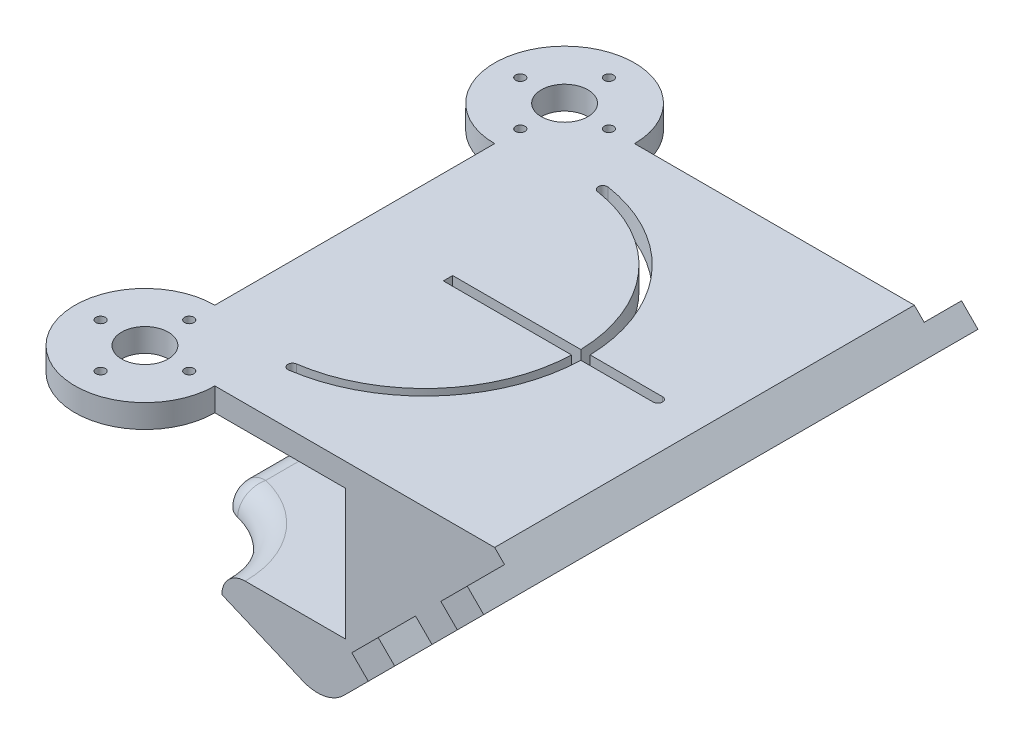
ISO-10303-21;
HEADER;
FILE_DESCRIPTION(('STEP AP214'),'2;1');
FILE_NAME('part.step','',(''),(''),'','','');
FILE_SCHEMA(('AUTOMOTIVE_DESIGN { 1 0 10303 214 1 1 1 1 }'));
ENDSEC;
DATA;
#1=APPLICATION_CONTEXT('core data for automotive mechanical design processes');
#2=APPLICATION_PROTOCOL_DEFINITION('international standard','automotive_design',2000,#1);
#3=PRODUCT_CONTEXT('',#1,'mechanical');
#4=PRODUCT('Part','Part','',(#3));
#5=PRODUCT_RELATED_PRODUCT_CATEGORY('part','',(#4));
#6=PRODUCT_DEFINITION_FORMATION('','',#4);
#7=PRODUCT_DEFINITION_CONTEXT('part definition',#1,'design');
#8=PRODUCT_DEFINITION('design','',#6,#7);
#9=PRODUCT_DEFINITION_SHAPE('','',#8);
#10=(LENGTH_UNIT() NAMED_UNIT(*) SI_UNIT(.MILLI.,.METRE.));
#11=(NAMED_UNIT(*) PLANE_ANGLE_UNIT() SI_UNIT($,.RADIAN.));
#12=(NAMED_UNIT(*) SI_UNIT($,.STERADIAN.) SOLID_ANGLE_UNIT());
#13=UNCERTAINTY_MEASURE_WITH_UNIT(LENGTH_MEASURE(1.E-05),#10,'distance_accuracy_value','');
#14=(GEOMETRIC_REPRESENTATION_CONTEXT(3) GLOBAL_UNCERTAINTY_ASSIGNED_CONTEXT((#13)) GLOBAL_UNIT_ASSIGNED_CONTEXT((#10,
#11,#12)) REPRESENTATION_CONTEXT('',''));
#15=CARTESIAN_POINT('',(0.,0.,0.));
#16=DIRECTION('',(0.,0.,1.));
#17=DIRECTION('',(1.,0.,0.));
#18=AXIS2_PLACEMENT_3D('',#15,#16,#17);
#19=CARTESIAN_POINT('',(36.9999999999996,3.67922914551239,107.535379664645));
#20=DIRECTION('',(0.,0.,-1.));
#21=DIRECTION('',(-1.,0.,0.));
#22=AXIS2_PLACEMENT_3D('',#19,#20,#21);
#23=CYLINDRICAL_SURFACE('',#22,8.00000000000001);
#24=CARTESIAN_POINT('',(36.9999999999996,3.67922914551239,33.1824817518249));
#25=DIRECTION('',(0.,0.,-1.));
#26=DIRECTION('',(-1.,0.,0.));
#27=AXIS2_PLACEMENT_3D('',#24,#25,#26);
#28=CIRCLE('',#27,8.00000000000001);
#29=CARTESIAN_POINT('',(33.8780487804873,-3.68646298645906,33.1824817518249));
#30=VERTEX_POINT('',#29);
#31=CARTESIAN_POINT('',(42.656854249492,-1.97762510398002,33.1824817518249));
#32=VERTEX_POINT('',#31);
#33=EDGE_CURVE('E691',#30,#32,#28,.F.);
#34=ORIENTED_EDGE('',*,*,#33,.F.);
#35=DIRECTION('',(0.,0.,-1.));
#36=VECTOR('',#35,1.);
#37=CARTESIAN_POINT('',(33.8780487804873,-3.68646298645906,107.535379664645));
#38=LINE('',#37,#36);
#39=CARTESIAN_POINT('',(33.8780487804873,-3.68646298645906,-9.81751824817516));
#40=VERTEX_POINT('',#39);
#41=EDGE_CURVE('E1018',#30,#40,#38,.T.);
#42=ORIENTED_EDGE('',*,*,#41,.T.);
#43=CARTESIAN_POINT('',(36.9999999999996,3.67922914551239,-9.81751824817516));
#44=DIRECTION('',(0.,0.,-1.));
#45=DIRECTION('',(-1.,0.,0.));
#46=AXIS2_PLACEMENT_3D('',#43,#44,#45);
#47=CIRCLE('',#46,8.00000000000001);
#48=CARTESIAN_POINT('',(42.656854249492,-1.97762510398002,-9.81751824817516));
#49=VERTEX_POINT('',#48);
#50=EDGE_CURVE('E1024',#49,#40,#47,.T.);
#51=ORIENTED_EDGE('',*,*,#50,.F.);
#52=DIRECTION('',(0.,0.,-1.));
#53=VECTOR('',#52,1.);
#54=CARTESIAN_POINT('',(42.656854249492,-1.97762510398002,80.1824817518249));
#55=LINE('',#54,#53);
#56=EDGE_CURVE('E709',#32,#49,#55,.T.);
#57=ORIENTED_EDGE('',*,*,#56,.F.);
#58=EDGE_LOOP('',(#34,#42,#51,#57));
#59=FACE_BOUND('',#58,.T.);
#60=ADVANCED_FACE('F87',(#59),#23,.T.);
#61=CARTESIAN_POINT('',(75.,41.6792291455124,-9.81751824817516));
#62=DIRECTION('',(0.,0.,1.));
#63=DIRECTION('',(1.,0.,0.));
#64=AXIS2_PLACEMENT_3D('',#61,#62,#63);
#65=PLANE('',#64);
#66=DIRECTION('',(-0.920711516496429,0.390243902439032,0.));
#67=VECTOR('',#66,1.);
#68=CARTESIAN_POINT('',(16.5,3.67922914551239,-9.81751824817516));
#69=LINE('',#68,#67);
#70=CARTESIAN_POINT('',(16.5,3.67922914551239,-9.81751824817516));
#71=VERTEX_POINT('',#70);
#72=EDGE_CURVE('E1021',#40,#71,#69,.T.);
#73=ORIENTED_EDGE('',*,*,#72,.T.);
#74=CARTESIAN_POINT('',(21.5,3.67922914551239,-9.81751824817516));
#75=DIRECTION('',(0.,0.,1.));
#76=DIRECTION('',(1.,0.,0.));
#77=AXIS2_PLACEMENT_3D('',#74,#75,#76);
#78=CIRCLE('',#77,5.);
#79=CARTESIAN_POINT('',(21.5,8.67922914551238,-9.81751824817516));
#80=VERTEX_POINT('',#79);
#81=EDGE_CURVE('E537',#71,#80,#78,.F.);
#82=ORIENTED_EDGE('',*,*,#81,.T.);
#83=DIRECTION('',(-1.,0.,0.));
#84=VECTOR('',#83,1.);
#85=CARTESIAN_POINT('',(0.,8.67922914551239,-9.81751824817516));
#86=LINE('',#85,#84);
#87=CARTESIAN_POINT('',(43.,8.67922914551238,-9.81751824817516));
#88=VERTEX_POINT('',#87);
#89=EDGE_CURVE('E796',#88,#80,#86,.T.);
#90=ORIENTED_EDGE('',*,*,#89,.F.);
#91=DIRECTION('',(0.,-1.,0.));
#92=VECTOR('',#91,1.);
#93=CARTESIAN_POINT('',(43.,36.6792291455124,-9.81751824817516));
#94=LINE('',#93,#92);
#95=CARTESIAN_POINT('',(43.,36.6792291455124,-9.81751824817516));
#96=VERTEX_POINT('',#95);
#97=EDGE_CURVE('E800',#96,#88,#94,.T.);
#98=ORIENTED_EDGE('',*,*,#97,.F.);
#99=DIRECTION('',(1.,0.,0.));
#100=VECTOR('',#99,1.);
#101=CARTESIAN_POINT('',(75.,36.6792291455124,-9.81751824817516));
#102=LINE('',#101,#100);
#103=CARTESIAN_POINT('',(15.,36.6792291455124,-9.81751824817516));
#104=VERTEX_POINT('',#103);
#105=EDGE_CURVE('E780',#104,#96,#102,.T.);
#106=ORIENTED_EDGE('',*,*,#105,.F.);
#107=DIRECTION('',(0.,1.,0.));
#108=VECTOR('',#107,1.);
#109=CARTESIAN_POINT('',(15.,-5.74717772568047,-9.81751824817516));
#110=LINE('',#109,#108);
#111=CARTESIAN_POINT('',(15.,41.6792291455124,-9.81751824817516));
#112=VERTEX_POINT('',#111);
#113=EDGE_CURVE('E815',#104,#112,#110,.T.);
#114=ORIENTED_EDGE('',*,*,#113,.T.);
#115=DIRECTION('',(-1.,0.,0.));
#116=VECTOR('',#115,1.);
#117=CARTESIAN_POINT('',(75.,41.6792291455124,-9.81751824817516));
#118=LINE('',#117,#116);
#119=CARTESIAN_POINT('',(75.,41.6792291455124,-9.81751824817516));
#120=VERTEX_POINT('',#119);
#121=EDGE_CURVE('E743',#120,#112,#118,.T.);
#122=ORIENTED_EDGE('',*,*,#121,.F.);
#123=DIRECTION('',(-0.707106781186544,0.707106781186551,0.));
#124=VECTOR('',#123,1.);
#125=CARTESIAN_POINT('',(80.6568542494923,36.02237489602,-9.81751824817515));
#126=LINE('',#125,#124);
#127=CARTESIAN_POINT('',(77.1213203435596,39.5579088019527,-9.81751824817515));
#128=VERTEX_POINT('',#127);
#129=EDGE_CURVE('E723',#128,#120,#126,.T.);
#130=ORIENTED_EDGE('',*,*,#129,.F.);
#131=DIRECTION('',(0.707106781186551,0.707106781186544,0.));
#132=VECTOR('',#131,1.);
#133=CARTESIAN_POINT('',(18.7817057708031,-18.7817057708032,-9.81751824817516));
#134=LINE('',#133,#132);
#135=CARTESIAN_POINT('',(71.4644660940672,33.9010545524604,-9.81751824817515));
#136=VERTEX_POINT('',#135);
#137=EDGE_CURVE('E990',#136,#128,#134,.T.);
#138=ORIENTED_EDGE('',*,*,#137,.F.);
#139=DIRECTION('',(0.707106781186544,-0.707106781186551,0.));
#140=VECTOR('',#139,1.);
#141=CARTESIAN_POINT('',(71.4644660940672,33.9010545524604,-9.81751824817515));
#142=LINE('',#141,#140);
#143=CARTESIAN_POINT('',(74.9999999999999,30.3655206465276,-9.81751824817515));
#144=VERTEX_POINT('',#143);
#145=EDGE_CURVE('E973',#136,#144,#142,.T.);
#146=ORIENTED_EDGE('',*,*,#145,.T.);
#147=DIRECTION('',(0.707106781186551,0.707106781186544,0.));
#148=VECTOR('',#147,1.);
#149=CARTESIAN_POINT('',(80.6568542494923,36.02237489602,-9.81751824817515));
#150=LINE('',#149,#148);
#151=CARTESIAN_POINT('',(61.5649711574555,16.9304918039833,-9.81751824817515));
#152=VERTEX_POINT('',#151);
#153=EDGE_CURVE('E708',#152,#144,#150,.T.);
#154=ORIENTED_EDGE('',*,*,#153,.F.);
#155=DIRECTION('',(0.707106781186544,-0.707106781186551,0.));
#156=VECTOR('',#155,1.);
#157=CARTESIAN_POINT('',(58.0294372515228,20.4660257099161,-9.81751824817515));
#158=LINE('',#157,#156);
#159=CARTESIAN_POINT('',(58.0294372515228,20.4660257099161,-9.81751824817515));
#160=VERTEX_POINT('',#159);
#161=EDGE_CURVE('E956',#160,#152,#158,.T.);
#162=ORIENTED_EDGE('',*,*,#161,.F.);
#163=DIRECTION('',(0.707106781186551,0.707106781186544,0.));
#164=VECTOR('',#163,1.);
#165=CARTESIAN_POINT('',(18.7817057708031,-18.7817057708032,-9.81751824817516));
#166=LINE('',#165,#164);
#167=CARTESIAN_POINT('',(52.3725830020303,14.8091714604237,-9.81751824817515));
#168=VERTEX_POINT('',#167);
#169=EDGE_CURVE('E954',#168,#160,#166,.T.);
#170=ORIENTED_EDGE('',*,*,#169,.F.);
#171=DIRECTION('',(0.707106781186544,-0.707106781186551,0.));
#172=VECTOR('',#171,1.);
#173=CARTESIAN_POINT('',(52.3725830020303,14.8091714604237,-9.81751824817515));
#174=LINE('',#173,#172);
#175=CARTESIAN_POINT('',(55.9081169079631,11.273637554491,-9.81751824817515));
#176=VERTEX_POINT('',#175);
#177=EDGE_CURVE('E938',#168,#176,#174,.T.);
#178=ORIENTED_EDGE('',*,*,#177,.T.);
#179=EDGE_CURVE('E712',#49,#176,#150,.T.);
#180=ORIENTED_EDGE('',*,*,#179,.F.);
#181=ORIENTED_EDGE('',*,*,#50,.T.);
#182=EDGE_LOOP('',(#73,#82,#90,#98,#106,#114,#122,#130,#138,#146,#154,#162,#170,#178,#180,#181));
#183=FACE_BOUND('',#182,.T.);
#184=ADVANCED_FACE('F609',(#183),#65,.F.);
#185=CARTESIAN_POINT('',(75.,41.6792291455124,80.1824817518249));
#186=DIRECTION('',(0.,0.,-1.));
#187=DIRECTION('',(-1.,0.,0.));
#188=AXIS2_PLACEMENT_3D('',#185,#186,#187);
#189=PLANE('',#188);
#190=DIRECTION('',(1.,0.,0.));
#191=VECTOR('',#190,1.);
#192=CARTESIAN_POINT('',(0.,8.67922914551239,80.1824817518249));
#193=LINE('',#192,#191);
#194=CARTESIAN_POINT('',(21.5,8.67922914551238,80.1824817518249));
#195=VERTEX_POINT('',#194);
#196=CARTESIAN_POINT('',(43.,8.67922914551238,80.1824817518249));
#197=VERTEX_POINT('',#196);
#198=EDGE_CURVE('E795',#195,#197,#193,.T.);
#199=ORIENTED_EDGE('',*,*,#198,.F.);
#200=CARTESIAN_POINT('',(21.5,3.67922914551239,80.1824817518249));
#201=DIRECTION('',(0.,0.,-1.));
#202=DIRECTION('',(-1.,0.,0.));
#203=AXIS2_PLACEMENT_3D('',#200,#201,#202);
#204=CIRCLE('',#203,5.);
#205=CARTESIAN_POINT('',(16.5,3.67922914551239,80.1824817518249));
#206=VERTEX_POINT('',#205);
#207=EDGE_CURVE('E543',#195,#206,#204,.F.);
#208=ORIENTED_EDGE('',*,*,#207,.T.);
#209=DIRECTION('',(0.92071151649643,-0.390243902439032,0.));
#210=VECTOR('',#209,1.);
#211=CARTESIAN_POINT('',(16.5,3.67922914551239,80.1824817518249));
#212=LINE('',#211,#210);
#213=CARTESIAN_POINT('',(33.8780487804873,-3.68646298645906,80.1824817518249));
#214=VERTEX_POINT('',#213);
#215=EDGE_CURVE('E1015',#206,#214,#212,.T.);
#216=ORIENTED_EDGE('',*,*,#215,.T.);
#217=CARTESIAN_POINT('',(36.9999999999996,3.67922914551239,80.1824817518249));
#218=DIRECTION('',(0.,0.,-1.));
#219=DIRECTION('',(-1.,0.,0.));
#220=AXIS2_PLACEMENT_3D('',#217,#218,#219);
#221=CIRCLE('',#220,8.00000000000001);
#222=CARTESIAN_POINT('',(42.656854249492,-1.97762510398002,80.1824817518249));
#223=VERTEX_POINT('',#222);
#224=EDGE_CURVE('E1003',#214,#223,#221,.F.);
#225=ORIENTED_EDGE('',*,*,#224,.T.);
#226=DIRECTION('',(-0.707106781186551,-0.707106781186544,0.));
#227=VECTOR('',#226,1.);
#228=CARTESIAN_POINT('',(80.6568542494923,36.02237489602,80.1824817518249));
#229=LINE('',#228,#227);
#230=CARTESIAN_POINT('',(55.9081169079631,11.2736375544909,80.1824817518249));
#231=VERTEX_POINT('',#230);
#232=EDGE_CURVE('E706',#231,#223,#229,.T.);
#233=ORIENTED_EDGE('',*,*,#232,.F.);
#234=DIRECTION('',(0.707106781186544,-0.707106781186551,0.));
#235=VECTOR('',#234,1.);
#236=CARTESIAN_POINT('',(52.3725830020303,14.8091714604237,80.1824817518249));
#237=LINE('',#236,#235);
#238=CARTESIAN_POINT('',(52.3725830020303,14.8091714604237,80.1824817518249));
#239=VERTEX_POINT('',#238);
#240=EDGE_CURVE('E921',#239,#231,#237,.T.);
#241=ORIENTED_EDGE('',*,*,#240,.F.);
#242=DIRECTION('',(-0.707106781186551,-0.707106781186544,0.));
#243=VECTOR('',#242,1.);
#244=CARTESIAN_POINT('',(18.7817057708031,-18.7817057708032,80.1824817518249));
#245=LINE('',#244,#243);
#246=CARTESIAN_POINT('',(58.0294372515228,20.4660257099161,80.1824817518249));
#247=VERTEX_POINT('',#246);
#248=EDGE_CURVE('E919',#247,#239,#245,.T.);
#249=ORIENTED_EDGE('',*,*,#248,.F.);
#250=DIRECTION('',(0.707106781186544,-0.707106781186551,0.));
#251=VECTOR('',#250,1.);
#252=CARTESIAN_POINT('',(58.0294372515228,20.4660257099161,80.1824817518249));
#253=LINE('',#252,#251);
#254=CARTESIAN_POINT('',(61.5649711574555,16.9304918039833,80.1824817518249));
#255=VERTEX_POINT('',#254);
#256=EDGE_CURVE('E902',#247,#255,#253,.T.);
#257=ORIENTED_EDGE('',*,*,#256,.T.);
#258=CARTESIAN_POINT('',(74.9999999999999,30.3655206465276,80.1824817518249));
#259=VERTEX_POINT('',#258);
#260=EDGE_CURVE('E714',#259,#255,#229,.T.);
#261=ORIENTED_EDGE('',*,*,#260,.F.);
#262=DIRECTION('',(0.707106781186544,-0.707106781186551,0.));
#263=VECTOR('',#262,1.);
#264=CARTESIAN_POINT('',(71.4644660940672,33.9010545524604,80.1824817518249));
#265=LINE('',#264,#263);
#266=CARTESIAN_POINT('',(71.4644660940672,33.9010545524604,80.1824817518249));
#267=VERTEX_POINT('',#266);
#268=EDGE_CURVE('E886',#267,#259,#265,.T.);
#269=ORIENTED_EDGE('',*,*,#268,.F.);
#270=DIRECTION('',(-0.707106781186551,-0.707106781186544,0.));
#271=VECTOR('',#270,1.);
#272=CARTESIAN_POINT('',(18.7817057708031,-18.7817057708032,80.1824817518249));
#273=LINE('',#272,#271);
#274=CARTESIAN_POINT('',(77.1213203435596,39.5579088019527,80.1824817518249));
#275=VERTEX_POINT('',#274);
#276=EDGE_CURVE('E905',#275,#267,#273,.T.);
#277=ORIENTED_EDGE('',*,*,#276,.F.);
#278=DIRECTION('',(-0.707106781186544,0.707106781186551,0.));
#279=VECTOR('',#278,1.);
#280=CARTESIAN_POINT('',(80.6568542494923,36.02237489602,80.1824817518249));
#281=LINE('',#280,#279);
#282=CARTESIAN_POINT('',(75.,41.6792291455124,80.1824817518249));
#283=VERTEX_POINT('',#282);
#284=EDGE_CURVE('E721',#275,#283,#281,.T.);
#285=ORIENTED_EDGE('',*,*,#284,.T.);
#286=DIRECTION('',(-1.,0.,0.));
#287=VECTOR('',#286,1.);
#288=CARTESIAN_POINT('',(75.,41.6792291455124,80.1824817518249));
#289=LINE('',#288,#287);
#290=CARTESIAN_POINT('',(15.,41.6792291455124,80.1824817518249));
#291=VERTEX_POINT('',#290);
#292=EDGE_CURVE('E735',#283,#291,#289,.T.);
#293=ORIENTED_EDGE('',*,*,#292,.T.);
#294=DIRECTION('',(0.,1.,0.));
#295=VECTOR('',#294,1.);
#296=CARTESIAN_POINT('',(15.,-5.74717772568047,80.1824817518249));
#297=LINE('',#296,#295);
#298=CARTESIAN_POINT('',(15.,36.6792291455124,80.1824817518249));
#299=VERTEX_POINT('',#298);
#300=EDGE_CURVE('E803',#291,#299,#297,.F.);
#301=ORIENTED_EDGE('',*,*,#300,.T.);
#302=DIRECTION('',(-1.,0.,0.));
#303=VECTOR('',#302,1.);
#304=CARTESIAN_POINT('',(75.,36.6792291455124,80.1824817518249));
#305=LINE('',#304,#303);
#306=CARTESIAN_POINT('',(43.,36.6792291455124,80.1824817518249));
#307=VERTEX_POINT('',#306);
#308=EDGE_CURVE('E786',#307,#299,#305,.T.);
#309=ORIENTED_EDGE('',*,*,#308,.F.);
#310=DIRECTION('',(0.,1.,0.));
#311=VECTOR('',#310,1.);
#312=CARTESIAN_POINT('',(43.,36.6792291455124,80.1824817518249));
#313=LINE('',#312,#311);
#314=EDGE_CURVE('E799',#197,#307,#313,.T.);
#315=ORIENTED_EDGE('',*,*,#314,.F.);
#316=EDGE_LOOP('',(#199,#208,#216,#225,#233,#241,#249,#257,#261,#269,#277,#285,#293,#301,#309,#315));
#317=FACE_BOUND('',#316,.T.);
#318=ADVANCED_FACE('F612',(#317),#189,.F.);
#319=CARTESIAN_POINT('',(75.,3.67922914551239,80.1824817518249));
#320=DIRECTION('',(0.,1.,0.));
#321=DIRECTION('',(0.,0.,1.));
#322=AXIS2_PLACEMENT_3D('',#319,#320,#321);
#323=PLANE('',#322);
#324=DIRECTION('',(0.,0.,-1.));
#325=VECTOR('',#324,1.);
#326=CARTESIAN_POINT('',(0.,3.67922914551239,80.1824817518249));
#327=LINE('',#326,#325);
#328=CARTESIAN_POINT('',(0.,3.67922914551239,59.2719580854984));
#329=VERTEX_POINT('',#328);
#330=CARTESIAN_POINT('',(0.,3.67922914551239,11.0930054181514));
#331=VERTEX_POINT('',#330);
#332=EDGE_CURVE('E731',#329,#331,#327,.T.);
#333=ORIENTED_EDGE('',*,*,#332,.T.);
#334=CARTESIAN_POINT('',(5.,3.67922914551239,11.0930054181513));
#335=DIRECTION('',(0.,1.,0.));
#336=DIRECTION('',(0.,0.,1.));
#337=AXIS2_PLACEMENT_3D('',#334,#335,#336);
#338=CIRCLE('',#337,5.);
#339=CARTESIAN_POINT('',(3.83720930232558,3.67922914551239,6.23009293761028));
#340=VERTEX_POINT('',#339);
#341=EDGE_CURVE('E527',#331,#340,#338,.F.);
#342=ORIENTED_EDGE('',*,*,#341,.T.);
#343=CARTESIAN_POINT('',(0.,3.67922914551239,-9.81751824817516));
#344=DIRECTION('',(0.,-1.,0.));
#345=DIRECTION('',(0.,0.,-1.));
#346=AXIS2_PLACEMENT_3D('',#343,#344,#345);
#347=CIRCLE('',#346,16.5);
#348=EDGE_CURVE('E783',#71,#340,#347,.T.);
#349=ORIENTED_EDGE('',*,*,#348,.F.);
#350=DIRECTION('',(0.,0.,-1.));
#351=VECTOR('',#350,1.);
#352=CARTESIAN_POINT('',(16.5,3.67922914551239,107.535379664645));
#353=LINE('',#352,#351);
#354=EDGE_CURVE('E1017',#206,#71,#353,.T.);
#355=ORIENTED_EDGE('',*,*,#354,.F.);
#356=CARTESIAN_POINT('',(0.,3.67922914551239,80.1824817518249));
#357=DIRECTION('',(0.,-1.,0.));
#358=DIRECTION('',(0.,0.,-1.));
#359=AXIS2_PLACEMENT_3D('',#356,#357,#358);
#360=CIRCLE('',#359,16.5);
#361=CARTESIAN_POINT('',(3.83720930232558,3.67922914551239,64.1348705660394));
#362=VERTEX_POINT('',#361);
#363=EDGE_CURVE('E789',#362,#206,#360,.T.);
#364=ORIENTED_EDGE('',*,*,#363,.F.);
#365=CARTESIAN_POINT('',(5.,3.67922914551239,59.2719580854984));
#366=DIRECTION('',(0.,1.,0.));
#367=DIRECTION('',(0.,0.,1.));
#368=AXIS2_PLACEMENT_3D('',#365,#366,#367);
#369=CIRCLE('',#368,5.);
#370=EDGE_CURVE('E525',#362,#329,#369,.F.);
#371=ORIENTED_EDGE('',*,*,#370,.T.);
#372=EDGE_LOOP('',(#333,#342,#349,#355,#364,#371));
#373=FACE_BOUND('',#372,.T.);
#374=ADVANCED_FACE('F607',(#373),#323,.F.);
#375=CARTESIAN_POINT('',(75.,41.6792291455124,80.1824817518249));
#376=DIRECTION('',(0.,-1.,0.));
#377=DIRECTION('',(0.,0.,-1.));
#378=AXIS2_PLACEMENT_3D('',#375,#376,#377);
#379=PLANE('',#378);
#380=CARTESIAN_POINT('',(15.,41.6792291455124,35.1824817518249));
#381=DIRECTION('',(0.,1.,0.));
#382=DIRECTION('',(0.,0.,1.));
#383=AXIS2_PLACEMENT_3D('',#380,#381,#382);
#384=CIRCLE('',#383,34.5);
#385=CARTESIAN_POINT('',(49.4855042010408,41.6792291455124,34.1824817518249));
#386=VERTEX_POINT('',#385);
#387=CARTESIAN_POINT('',(20.2459717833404,41.6792291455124,1.08365801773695));
#388=VERTEX_POINT('',#387);
#389=EDGE_CURVE('E1054',#386,#388,#384,.T.);
#390=ORIENTED_EDGE('',*,*,#389,.F.);
#391=DIRECTION('',(-1.,0.,0.));
#392=VECTOR('',#391,1.);
#393=CARTESIAN_POINT('',(0.,41.6792291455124,34.1824817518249));
#394=LINE('',#393,#392);
#395=CARTESIAN_POINT('',(65.,41.6792291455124,34.1824817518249));
#396=VERTEX_POINT('',#395);
#397=EDGE_CURVE('E1082',#396,#386,#394,.T.);
#398=ORIENTED_EDGE('',*,*,#397,.F.);
#399=CARTESIAN_POINT('',(65.,41.6792291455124,35.1824817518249));
#400=DIRECTION('',(0.,1.,0.));
#401=DIRECTION('',(0.,0.,1.));
#402=AXIS2_PLACEMENT_3D('',#399,#400,#401);
#403=CIRCLE('',#402,1.);
#404=CARTESIAN_POINT('',(65.,41.6792291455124,36.1824817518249));
#405=VERTEX_POINT('',#404);
#406=EDGE_CURVE('E1070',#405,#396,#403,.T.);
#407=ORIENTED_EDGE('',*,*,#406,.F.);
#408=DIRECTION('',(-1.,0.,0.));
#409=VECTOR('',#408,1.);
#410=CARTESIAN_POINT('',(0.,41.6792291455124,36.1824817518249));
#411=LINE('',#410,#409);
#412=CARTESIAN_POINT('',(49.4855042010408,41.6792291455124,36.1824817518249));
#413=VERTEX_POINT('',#412);
#414=EDGE_CURVE('E1079',#405,#413,#411,.T.);
#415=ORIENTED_EDGE('',*,*,#414,.T.);
#416=CARTESIAN_POINT('',(19.9483029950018,41.6792291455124,69.3257724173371));
#417=VERTEX_POINT('',#416);
#418=EDGE_CURVE('E1055',#417,#413,#384,.T.);
#419=ORIENTED_EDGE('',*,*,#418,.F.);
#420=CARTESIAN_POINT('',(19.8048739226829,41.6792291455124,68.3361118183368));
#421=DIRECTION('',(0.,1.,0.));
#422=DIRECTION('',(0.,0.,1.));
#423=AXIS2_PLACEMENT_3D('',#420,#421,#422);
#424=CIRCLE('',#423,1.00000000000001);
#425=CARTESIAN_POINT('',(19.661444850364,41.6792291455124,67.3464512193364));
#426=VERTEX_POINT('',#425);
#427=EDGE_CURVE('E1039',#426,#417,#424,.T.);
#428=ORIENTED_EDGE('',*,*,#427,.F.);
#429=CARTESIAN_POINT('',(15.,41.6792291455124,35.1824817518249));
#430=DIRECTION('',(0.,1.,0.));
#431=DIRECTION('',(0.,0.,1.));
#432=AXIS2_PLACEMENT_3D('',#429,#430,#431);
#433=CIRCLE('',#432,32.5);
#434=CARTESIAN_POINT('',(47.4846117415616,41.6792291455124,36.1824817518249));
#435=VERTEX_POINT('',#434);
#436=EDGE_CURVE('E1061',#426,#435,#433,.T.);
#437=ORIENTED_EDGE('',*,*,#436,.T.);
#438=DIRECTION('',(-1.,0.,0.));
#439=VECTOR('',#438,1.);
#440=CARTESIAN_POINT('',(0.,41.6792291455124,36.1824817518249));
#441=LINE('',#440,#439);
#442=CARTESIAN_POINT('',(20.,41.6792291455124,36.1824817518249));
#443=VERTEX_POINT('',#442);
#444=EDGE_CURVE('E1099',#435,#443,#441,.T.);
#445=ORIENTED_EDGE('',*,*,#444,.T.);
#446=DIRECTION('',(0.,0.,1.));
#447=VECTOR('',#446,1.);
#448=CARTESIAN_POINT('',(20.,41.6792291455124,0.));
#449=LINE('',#448,#447);
#450=CARTESIAN_POINT('',(20.,41.6792291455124,34.1824817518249));
#451=VERTEX_POINT('',#450);
#452=EDGE_CURVE('E1095',#451,#443,#449,.T.);
#453=ORIENTED_EDGE('',*,*,#452,.F.);
#454=DIRECTION('',(-1.,0.,0.));
#455=VECTOR('',#454,1.);
#456=CARTESIAN_POINT('',(0.,41.6792291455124,34.1824817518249));
#457=LINE('',#456,#455);
#458=CARTESIAN_POINT('',(47.4846117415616,41.6792291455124,34.1824817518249));
#459=VERTEX_POINT('',#458);
#460=EDGE_CURVE('E1110',#459,#451,#457,.T.);
#461=ORIENTED_EDGE('',*,*,#460,.F.);
#462=CARTESIAN_POINT('',(19.9418574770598,41.6792291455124,3.06040142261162));
#463=VERTEX_POINT('',#462);
#464=EDGE_CURVE('E1042',#459,#463,#433,.T.);
#465=ORIENTED_EDGE('',*,*,#464,.T.);
#466=CARTESIAN_POINT('',(20.0939146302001,41.6792291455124,2.07202972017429));
#467=DIRECTION('',(0.,1.,0.));
#468=DIRECTION('',(0.,0.,1.));
#469=AXIS2_PLACEMENT_3D('',#466,#467,#468);
#470=CIRCLE('',#469,1.);
#471=EDGE_CURVE('E1058',#388,#463,#470,.T.);
#472=ORIENTED_EDGE('',*,*,#471,.F.);
#473=EDGE_LOOP('',(#390,#398,#407,#415,#419,#428,#437,#445,#453,#461,#465,#472));
#474=FACE_BOUND('',#473,.T.);
#475=CARTESIAN_POINT('',(0.,41.6792291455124,70.6824817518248));
#476=DIRECTION('',(0.,-1.,0.));
#477=DIRECTION('',(0.,0.,-1.));
#478=AXIS2_PLACEMENT_3D('',#475,#476,#477);
#479=CIRCLE('',#478,0.999999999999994);
#480=CARTESIAN_POINT('',(0.,41.6792291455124,69.6824817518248));
#481=VERTEX_POINT('',#480);
#482=EDGE_CURVE('E854',#481,#481,#479,.F.);
#483=ORIENTED_EDGE('',*,*,#482,.F.);
#484=EDGE_LOOP('',(#483));
#485=FACE_BOUND('',#484,.T.);
#486=CARTESIAN_POINT('',(9.5,41.6792291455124,80.1824817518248));
#487=DIRECTION('',(0.,-1.,0.));
#488=DIRECTION('',(0.,0.,-1.));
#489=AXIS2_PLACEMENT_3D('',#486,#487,#488);
#490=CIRCLE('',#489,0.999999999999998);
#491=CARTESIAN_POINT('',(9.5,41.6792291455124,79.1824817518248));
#492=VERTEX_POINT('',#491);
#493=EDGE_CURVE('E862',#492,#492,#490,.F.);
#494=ORIENTED_EDGE('',*,*,#493,.F.);
#495=EDGE_LOOP('',(#494));
#496=FACE_BOUND('',#495,.T.);
#497=CARTESIAN_POINT('',(0.,41.6792291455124,89.6824817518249));
#498=DIRECTION('',(0.,-1.,0.));
#499=DIRECTION('',(0.,0.,-1.));
#500=AXIS2_PLACEMENT_3D('',#497,#498,#499);
#501=CIRCLE('',#500,0.999999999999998);
#502=CARTESIAN_POINT('',(0.,41.6792291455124,88.6824817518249));
#503=VERTEX_POINT('',#502);
#504=EDGE_CURVE('E868',#503,#503,#501,.F.);
#505=ORIENTED_EDGE('',*,*,#504,.F.);
#506=EDGE_LOOP('',(#505));
#507=FACE_BOUND('',#506,.T.);
#508=CARTESIAN_POINT('',(0.,41.6792291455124,-19.3175182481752));
#509=DIRECTION('',(0.,-1.,0.));
#510=DIRECTION('',(0.,0.,-1.));
#511=AXIS2_PLACEMENT_3D('',#508,#509,#510);
#512=CIRCLE('',#511,1.);
#513=CARTESIAN_POINT('',(0.,41.6792291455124,-20.3175182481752));
#514=VERTEX_POINT('',#513);
#515=EDGE_CURVE('E874',#514,#514,#512,.F.);
#516=ORIENTED_EDGE('',*,*,#515,.F.);
#517=EDGE_LOOP('',(#516));
#518=FACE_BOUND('',#517,.T.);
#519=CARTESIAN_POINT('',(9.5,41.6792291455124,-9.81751824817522));
#520=DIRECTION('',(0.,-1.,0.));
#521=DIRECTION('',(0.,0.,-1.));
#522=AXIS2_PLACEMENT_3D('',#519,#520,#521);
#523=CIRCLE('',#522,1.);
#524=CARTESIAN_POINT('',(9.5,41.6792291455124,-10.8175182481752));
#525=VERTEX_POINT('',#524);
#526=EDGE_CURVE('E849',#525,#525,#523,.F.);
#527=ORIENTED_EDGE('',*,*,#526,.F.);
#528=EDGE_LOOP('',(#527));
#529=FACE_BOUND('',#528,.T.);
#530=CARTESIAN_POINT('',(0.,41.6792291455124,80.1824817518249));
#531=DIRECTION('',(0.,-1.,0.));
#532=DIRECTION('',(0.,0.,-1.));
#533=AXIS2_PLACEMENT_3D('',#530,#531,#532);
#534=CIRCLE('',#533,5.);
#535=CARTESIAN_POINT('',(0.,41.6792291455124,75.1824817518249));
#536=VERTEX_POINT('',#535);
#537=EDGE_CURVE('E829',#536,#536,#534,.F.);
#538=ORIENTED_EDGE('',*,*,#537,.F.);
#539=EDGE_LOOP('',(#538));
#540=FACE_BOUND('',#539,.T.);
#541=CARTESIAN_POINT('',(-9.5,41.6792291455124,-9.81751824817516));
#542=DIRECTION('',(0.,-1.,0.));
#543=DIRECTION('',(0.,0.,-1.));
#544=AXIS2_PLACEMENT_3D('',#541,#542,#543);
#545=CIRCLE('',#544,1.);
#546=CARTESIAN_POINT('',(-9.5,41.6792291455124,-10.8175182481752));
#547=VERTEX_POINT('',#546);
#548=EDGE_CURVE('E830',#547,#547,#545,.F.);
#549=ORIENTED_EDGE('',*,*,#548,.F.);
#550=EDGE_LOOP('',(#549));
#551=FACE_BOUND('',#550,.T.);
#552=CARTESIAN_POINT('',(-9.5,41.6792291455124,80.1824817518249));
#553=DIRECTION('',(0.,-1.,0.));
#554=DIRECTION('',(0.,0.,-1.));
#555=AXIS2_PLACEMENT_3D('',#552,#553,#554);
#556=CIRCLE('',#555,1.);
#557=CARTESIAN_POINT('',(-9.5,41.6792291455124,79.1824817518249));
#558=VERTEX_POINT('',#557);
#559=EDGE_CURVE('E837',#558,#558,#556,.F.);
#560=ORIENTED_EDGE('',*,*,#559,.F.);
#561=EDGE_LOOP('',(#560));
#562=FACE_BOUND('',#561,.T.);
#563=CARTESIAN_POINT('',(0.,41.6792291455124,-0.317518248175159));
#564=DIRECTION('',(0.,-1.,0.));
#565=DIRECTION('',(0.,0.,-1.));
#566=AXIS2_PLACEMENT_3D('',#563,#564,#565);
#567=CIRCLE('',#566,1.);
#568=CARTESIAN_POINT('',(0.,41.6792291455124,-1.31751824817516));
#569=VERTEX_POINT('',#568);
#570=EDGE_CURVE('E842',#569,#569,#567,.F.);
#571=ORIENTED_EDGE('',*,*,#570,.F.);
#572=EDGE_LOOP('',(#571));
#573=FACE_BOUND('',#572,.T.);
#574=CARTESIAN_POINT('',(0.,41.6792291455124,-9.81751824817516));
#575=DIRECTION('',(0.,-1.,0.));
#576=DIRECTION('',(0.,0.,-1.));
#577=AXIS2_PLACEMENT_3D('',#574,#575,#576);
#578=CIRCLE('',#577,5.);
#579=CARTESIAN_POINT('',(0.,41.6792291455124,-14.8175182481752));
#580=VERTEX_POINT('',#579);
#581=EDGE_CURVE('E823',#580,#580,#578,.F.);
#582=ORIENTED_EDGE('',*,*,#581,.F.);
#583=EDGE_LOOP('',(#582));
#584=FACE_BOUND('',#583,.T.);
#585=CARTESIAN_POINT('',(0.,41.6792291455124,-9.81751824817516));
#586=DIRECTION('',(0.,1.,0.));
#587=DIRECTION('',(0.,0.,1.));
#588=AXIS2_PLACEMENT_3D('',#585,#586,#587);
#589=CIRCLE('',#588,15.);
#590=CARTESIAN_POINT('',(0.,41.6792291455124,5.18248175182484));
#591=VERTEX_POINT('',#590);
#592=EDGE_CURVE('E820',#112,#591,#589,.T.);
#593=ORIENTED_EDGE('',*,*,#592,.T.);
#594=DIRECTION('',(0.,0.,1.));
#595=VECTOR('',#594,1.);
#596=CARTESIAN_POINT('',(0.,41.6792291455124,80.1824817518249));
#597=LINE('',#596,#595);
#598=CARTESIAN_POINT('',(0.,41.6792291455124,65.1824817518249));
#599=VERTEX_POINT('',#598);
#600=EDGE_CURVE('E736',#591,#599,#597,.T.);
#601=ORIENTED_EDGE('',*,*,#600,.T.);
#602=CARTESIAN_POINT('',(0.,41.6792291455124,80.1824817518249));
#603=DIRECTION('',(0.,1.,0.));
#604=DIRECTION('',(0.,0.,1.));
#605=AXIS2_PLACEMENT_3D('',#602,#603,#604);
#606=CIRCLE('',#605,15.);
#607=EDGE_CURVE('E812',#599,#291,#606,.T.);
#608=ORIENTED_EDGE('',*,*,#607,.T.);
#609=ORIENTED_EDGE('',*,*,#292,.F.);
#610=DIRECTION('',(0.,0.,1.));
#611=VECTOR('',#610,1.);
#612=CARTESIAN_POINT('',(75.,41.6792291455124,80.1824817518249));
#613=LINE('',#612,#611);
#614=EDGE_CURVE('E732',#120,#283,#613,.T.);
#615=ORIENTED_EDGE('',*,*,#614,.F.);
#616=ORIENTED_EDGE('',*,*,#121,.T.);
#617=EDGE_LOOP('',(#593,#601,#608,#609,#615,#616));
#618=FACE_BOUND('',#617,.T.);
#619=ADVANCED_FACE('F603',(#474,#485,#496,#507,#518,#529,#540,#551,#562,#573,#584,#618),#379,.F.);
#620=CARTESIAN_POINT('',(75.,36.6792291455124,75.1824817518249));
#621=DIRECTION('',(0.,0.,-1.));
#622=DIRECTION('',(-1.,0.,0.));
#623=AXIS2_PLACEMENT_3D('',#620,#621,#622);
#624=PLANE('',#623);
#625=DIRECTION('',(-1.,0.,0.));
#626=VECTOR('',#625,1.);
#627=CARTESIAN_POINT('',(75.,8.67922914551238,75.1824817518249));
#628=LINE('',#627,#626);
#629=CARTESIAN_POINT('',(48.,8.67922914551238,75.1824817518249));
#630=VERTEX_POINT('',#629);
#631=CARTESIAN_POINT('',(39.9289321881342,8.67922914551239,75.1824817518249));
#632=VERTEX_POINT('',#631);
#633=EDGE_CURVE('E493',#630,#632,#628,.T.);
#634=ORIENTED_EDGE('',*,*,#633,.F.);
#635=DIRECTION('',(0.,-1.,0.));
#636=VECTOR('',#635,1.);
#637=CARTESIAN_POINT('',(48.,36.6792291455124,75.1824817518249));
#638=LINE('',#637,#636);
#639=CARTESIAN_POINT('',(48.,36.6792291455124,75.1824817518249));
#640=VERTEX_POINT('',#639);
#641=EDGE_CURVE('E529',#630,#640,#638,.F.);
#642=ORIENTED_EDGE('',*,*,#641,.T.);
#643=DIRECTION('',(-1.,0.,0.));
#644=VECTOR('',#643,1.);
#645=CARTESIAN_POINT('',(75.,36.6792291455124,75.1824817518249));
#646=LINE('',#645,#644);
#647=CARTESIAN_POINT('',(67.9289321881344,36.6792291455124,75.1824817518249));
#648=VERTEX_POINT('',#647);
#649=EDGE_CURVE('E725',#648,#640,#646,.T.);
#650=ORIENTED_EDGE('',*,*,#649,.F.);
#651=CARTESIAN_POINT('',(67.9289321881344,31.6792291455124,75.1824817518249));
#652=DIRECTION('',(0.,0.,-1.));
#653=DIRECTION('',(-1.,0.,0.));
#654=AXIS2_PLACEMENT_3D('',#651,#652,#653);
#655=CIRCLE('',#654,5.);
#656=CARTESIAN_POINT('',(71.4644660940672,35.2147630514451,75.1824817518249));
#657=VERTEX_POINT('',#656);
#658=EDGE_CURVE('E752',#648,#657,#655,.T.);
#659=ORIENTED_EDGE('',*,*,#658,.T.);
#660=DIRECTION('',(-0.707106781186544,0.707106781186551,0.));
#661=VECTOR('',#660,1.);
#662=CARTESIAN_POINT('',(75.6568542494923,31.02237489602,75.1824817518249));
#663=LINE('',#662,#661);
#664=CARTESIAN_POINT('',(72.8284271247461,33.8508020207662,75.1824817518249));
#665=VERTEX_POINT('',#664);
#666=EDGE_CURVE('E773',#665,#657,#663,.T.);
#667=ORIENTED_EDGE('',*,*,#666,.F.);
#668=CARTESIAN_POINT('',(75.6568542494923,36.6792291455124,75.1824817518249));
#669=DIRECTION('',(0.,0.,-1.));
#670=DIRECTION('',(-1.,0.,0.));
#671=AXIS2_PLACEMENT_3D('',#668,#669,#670);
#672=CIRCLE('',#671,4.);
#673=CARTESIAN_POINT('',(78.4852813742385,33.8508020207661,75.1824817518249));
#674=VERTEX_POINT('',#673);
#675=EDGE_CURVE('E514',#665,#674,#672,.F.);
#676=ORIENTED_EDGE('',*,*,#675,.T.);
#677=DIRECTION('',(-0.707106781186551,-0.707106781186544,0.));
#678=VECTOR('',#677,1.);
#679=CARTESIAN_POINT('',(75.6568542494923,31.02237489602,75.1824817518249));
#680=LINE('',#679,#678);
#681=CARTESIAN_POINT('',(47.656854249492,3.02237489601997,75.1824817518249));
#682=VERTEX_POINT('',#681);
#683=EDGE_CURVE('E768',#674,#682,#680,.T.);
#684=ORIENTED_EDGE('',*,*,#683,.T.);
#685=DIRECTION('',(-0.707106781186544,0.707106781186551,0.));
#686=VECTOR('',#685,1.);
#687=CARTESIAN_POINT('',(47.656854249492,3.02237489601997,75.1824817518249));
#688=LINE('',#687,#686);
#689=CARTESIAN_POINT('',(43.4644660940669,7.21476305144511,75.1824817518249));
#690=VERTEX_POINT('',#689);
#691=EDGE_CURVE('E763',#682,#690,#688,.T.);
#692=ORIENTED_EDGE('',*,*,#691,.T.);
#693=CARTESIAN_POINT('',(39.9289321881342,3.67922914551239,75.1824817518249));
#694=DIRECTION('',(0.,0.,-1.));
#695=DIRECTION('',(-1.,0.,0.));
#696=AXIS2_PLACEMENT_3D('',#693,#694,#695);
#697=CIRCLE('',#696,5.);
#698=EDGE_CURVE('E495',#690,#632,#697,.F.);
#699=ORIENTED_EDGE('',*,*,#698,.T.);
#700=EDGE_LOOP('',(#634,#642,#650,#659,#667,#676,#684,#692,#699));
#701=FACE_BOUND('',#700,.T.);
#702=ADVANCED_FACE('F600',(#701),#624,.T.);
#703=CARTESIAN_POINT('',(75.,8.67922914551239,75.1824817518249));
#704=DIRECTION('',(0.,1.,0.));
#705=DIRECTION('',(0.,0.,1.));
#706=AXIS2_PLACEMENT_3D('',#703,#704,#705);
#707=PLANE('',#706);
#708=DIRECTION('',(-1.,0.,0.));
#709=VECTOR('',#708,1.);
#710=CARTESIAN_POINT('',(21.6891758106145,8.67922914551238,36.0208730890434));
#711=LINE('',#710,#709);
#712=CARTESIAN_POINT('',(39.9289321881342,8.67922914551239,36.0208730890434));
#713=VERTEX_POINT('',#712);
#714=CARTESIAN_POINT('',(21.6891758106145,8.67922914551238,36.0208730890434));
#715=VERTEX_POINT('',#714);
#716=EDGE_CURVE('E471',#713,#715,#711,.T.);
#717=ORIENTED_EDGE('',*,*,#716,.T.);
#718=CARTESIAN_POINT('',(21.6891758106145,8.67922914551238,35.2349028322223));
#719=DIRECTION('',(0.,1.,0.));
#720=DIRECTION('',(0.,0.,1.));
#721=AXIS2_PLACEMENT_3D('',#718,#719,#720);
#722=CIRCLE('',#721,0.785970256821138);
#723=CARTESIAN_POINT('',(21.6891758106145,8.67922914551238,34.4489325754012));
#724=VERTEX_POINT('',#723);
#725=EDGE_CURVE('E481',#715,#724,#722,.F.);
#726=ORIENTED_EDGE('',*,*,#725,.T.);
#727=DIRECTION('',(1.,0.,0.));
#728=VECTOR('',#727,1.);
#729=CARTESIAN_POINT('',(21.6891758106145,8.67922914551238,34.4489325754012));
#730=LINE('',#729,#728);
#731=CARTESIAN_POINT('',(39.9289321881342,8.67922914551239,34.4489325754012));
#732=VERTEX_POINT('',#731);
#733=EDGE_CURVE('E1147',#724,#732,#730,.T.);
#734=ORIENTED_EDGE('',*,*,#733,.T.);
#735=DIRECTION('',(0.,0.,1.));
#736=VECTOR('',#735,1.);
#737=CARTESIAN_POINT('',(39.9289321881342,8.67922914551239,75.1824817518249));
#738=LINE('',#737,#736);
#739=CARTESIAN_POINT('',(39.9289321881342,8.67922914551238,-4.81751824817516));
#740=VERTEX_POINT('',#739);
#741=EDGE_CURVE('E496',#732,#740,#738,.F.);
#742=ORIENTED_EDGE('',*,*,#741,.T.);
#743=DIRECTION('',(1.,0.,0.));
#744=VECTOR('',#743,1.);
#745=CARTESIAN_POINT('',(75.,8.67922914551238,-4.81751824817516));
#746=LINE('',#745,#744);
#747=CARTESIAN_POINT('',(48.,8.67922914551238,-4.81751824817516));
#748=VERTEX_POINT('',#747);
#749=EDGE_CURVE('E793',#740,#748,#746,.T.);
#750=ORIENTED_EDGE('',*,*,#749,.T.);
#751=CARTESIAN_POINT('',(48.,8.67922914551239,-9.81751824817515));
#752=DIRECTION('',(0.,1.,0.));
#753=DIRECTION('',(0.,0.,1.));
#754=AXIS2_PLACEMENT_3D('',#751,#752,#753);
#755=CIRCLE('',#754,5.);
#756=EDGE_CURVE('E551',#748,#88,#755,.F.);
#757=ORIENTED_EDGE('',*,*,#756,.T.);
#758=ORIENTED_EDGE('',*,*,#89,.T.);
#759=CARTESIAN_POINT('',(0.,8.67922914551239,-9.81751824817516));
#760=DIRECTION('',(0.,1.,0.));
#761=DIRECTION('',(0.,0.,1.));
#762=AXIS2_PLACEMENT_3D('',#759,#760,#761);
#763=CIRCLE('',#762,21.5);
#764=CARTESIAN_POINT('',(5.,8.67922914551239,11.0930054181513));
#765=VERTEX_POINT('',#764);
#766=EDGE_CURVE('E541',#80,#765,#763,.F.);
#767=ORIENTED_EDGE('',*,*,#766,.T.);
#768=DIRECTION('',(0.,0.,-1.));
#769=VECTOR('',#768,1.);
#770=CARTESIAN_POINT('',(5.,8.67922914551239,63.6824817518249));
#771=LINE('',#770,#769);
#772=CARTESIAN_POINT('',(5.,8.67922914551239,59.2719580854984));
#773=VERTEX_POINT('',#772);
#774=EDGE_CURVE('E505',#765,#773,#771,.F.);
#775=ORIENTED_EDGE('',*,*,#774,.T.);
#776=CARTESIAN_POINT('',(0.,8.67922914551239,80.1824817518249));
#777=DIRECTION('',(0.,1.,0.));
#778=DIRECTION('',(0.,0.,1.));
#779=AXIS2_PLACEMENT_3D('',#776,#777,#778);
#780=CIRCLE('',#779,21.5);
#781=EDGE_CURVE('E539',#773,#195,#780,.F.);
#782=ORIENTED_EDGE('',*,*,#781,.T.);
#783=ORIENTED_EDGE('',*,*,#198,.T.);
#784=CARTESIAN_POINT('',(48.,8.67922914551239,80.1824817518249));
#785=DIRECTION('',(0.,1.,0.));
#786=DIRECTION('',(0.,0.,1.));
#787=AXIS2_PLACEMENT_3D('',#784,#785,#786);
#788=CIRCLE('',#787,5.);
#789=EDGE_CURVE('E545',#197,#630,#788,.F.);
#790=ORIENTED_EDGE('',*,*,#789,.T.);
#791=ORIENTED_EDGE('',*,*,#633,.T.);
#792=EDGE_CURVE('E487',#632,#713,#738,.F.);
#793=ORIENTED_EDGE('',*,*,#792,.T.);
#794=EDGE_LOOP('',(#717,#726,#734,#742,#750,#757,#758,#767,#775,#782,#783,#790,#791,#793));
#795=FACE_BOUND('',#794,.T.);
#796=ADVANCED_FACE('F491',(#795),#707,.T.);
#797=CARTESIAN_POINT('',(75.,36.6792291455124,-4.81751824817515));
#798=DIRECTION('',(0.,0.,1.));
#799=DIRECTION('',(0.,-1.,0.));
#800=AXIS2_PLACEMENT_3D('',#797,#798,#799);
#801=PLANE('',#800);
#802=DIRECTION('',(-1.,0.,0.));
#803=VECTOR('',#802,1.);
#804=CARTESIAN_POINT('',(75.,36.6792291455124,-4.81751824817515));
#805=LINE('',#804,#803);
#806=CARTESIAN_POINT('',(67.9289321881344,36.6792291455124,-4.81751824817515));
#807=VERTEX_POINT('',#806);
#808=CARTESIAN_POINT('',(48.,36.6792291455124,-4.81751824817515));
#809=VERTEX_POINT('',#808);
#810=EDGE_CURVE('E728',#807,#809,#805,.T.);
#811=ORIENTED_EDGE('',*,*,#810,.T.);
#812=DIRECTION('',(0.,1.,0.));
#813=VECTOR('',#812,1.);
#814=CARTESIAN_POINT('',(48.,8.67922914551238,-4.81751824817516));
#815=LINE('',#814,#813);
#816=EDGE_CURVE('E531',#809,#748,#815,.F.);
#817=ORIENTED_EDGE('',*,*,#816,.T.);
#818=ORIENTED_EDGE('',*,*,#749,.F.);
#819=CARTESIAN_POINT('',(39.9289321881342,3.67922914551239,-4.81751824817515));
#820=DIRECTION('',(0.,0.,1.));
#821=DIRECTION('',(0.,-1.,0.));
#822=AXIS2_PLACEMENT_3D('',#819,#820,#821);
#823=CIRCLE('',#822,5.);
#824=CARTESIAN_POINT('',(43.4644660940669,7.21476305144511,-4.81751824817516));
#825=VERTEX_POINT('',#824);
#826=EDGE_CURVE('E498',#740,#825,#823,.F.);
#827=ORIENTED_EDGE('',*,*,#826,.T.);
#828=DIRECTION('',(-0.707106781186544,0.707106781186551,0.));
#829=VECTOR('',#828,1.);
#830=CARTESIAN_POINT('',(47.656854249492,3.02237489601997,-4.81751824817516));
#831=LINE('',#830,#829);
#832=CARTESIAN_POINT('',(47.656854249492,3.02237489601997,-4.81751824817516));
#833=VERTEX_POINT('',#832);
#834=EDGE_CURVE('E766',#833,#825,#831,.T.);
#835=ORIENTED_EDGE('',*,*,#834,.F.);
#836=DIRECTION('',(0.707106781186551,0.707106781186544,0.));
#837=VECTOR('',#836,1.);
#838=CARTESIAN_POINT('',(75.6568542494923,31.02237489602,-4.81751824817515));
#839=LINE('',#838,#837);
#840=CARTESIAN_POINT('',(78.4852813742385,33.8508020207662,-4.81751824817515));
#841=VERTEX_POINT('',#840);
#842=EDGE_CURVE('E775',#833,#841,#839,.T.);
#843=ORIENTED_EDGE('',*,*,#842,.T.);
#844=CARTESIAN_POINT('',(75.6568542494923,36.6792291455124,-4.81751824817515));
#845=DIRECTION('',(0.,0.,1.));
#846=DIRECTION('',(0.,-1.,0.));
#847=AXIS2_PLACEMENT_3D('',#844,#845,#846);
#848=CIRCLE('',#847,4.);
#849=CARTESIAN_POINT('',(72.8284271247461,33.8508020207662,-4.81751824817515));
#850=VERTEX_POINT('',#849);
#851=EDGE_CURVE('E517',#841,#850,#848,.F.);
#852=ORIENTED_EDGE('',*,*,#851,.T.);
#853=DIRECTION('',(-0.707106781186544,0.707106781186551,0.));
#854=VECTOR('',#853,1.);
#855=CARTESIAN_POINT('',(75.6568542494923,31.02237489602,-4.81751824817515));
#856=LINE('',#855,#854);
#857=CARTESIAN_POINT('',(71.4644660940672,35.2147630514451,-4.81751824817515));
#858=VERTEX_POINT('',#857);
#859=EDGE_CURVE('E769',#850,#858,#856,.T.);
#860=ORIENTED_EDGE('',*,*,#859,.T.);
#861=CARTESIAN_POINT('',(67.9289321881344,31.6792291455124,-4.81751824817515));
#862=DIRECTION('',(0.,0.,1.));
#863=DIRECTION('',(0.,-1.,0.));
#864=AXIS2_PLACEMENT_3D('',#861,#862,#863);
#865=CIRCLE('',#864,5.);
#866=EDGE_CURVE('E749',#858,#807,#865,.T.);
#867=ORIENTED_EDGE('',*,*,#866,.T.);
#868=EDGE_LOOP('',(#811,#817,#818,#827,#835,#843,#852,#860,#867));
#869=FACE_BOUND('',#868,.T.);
#870=ADVANCED_FACE('F593',(#869),#801,.T.);
#871=CARTESIAN_POINT('',(75.,36.6792291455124,75.1824817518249));
#872=DIRECTION('',(0.,-1.,0.));
#873=DIRECTION('',(0.,0.,-1.));
#874=AXIS2_PLACEMENT_3D('',#871,#872,#873);
#875=PLANE('',#874);
#876=DIRECTION('',(-1.,0.,0.));
#877=VECTOR('',#876,1.);
#878=CARTESIAN_POINT('',(0.,36.6792291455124,34.1824817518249));
#879=LINE('',#878,#877);
#880=CARTESIAN_POINT('',(65.,36.6792291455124,34.1824817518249));
#881=VERTEX_POINT('',#880);
#882=CARTESIAN_POINT('',(49.4855042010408,36.6792291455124,34.1824817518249));
#883=VERTEX_POINT('',#882);
#884=EDGE_CURVE('E1085',#881,#883,#879,.T.);
#885=ORIENTED_EDGE('',*,*,#884,.T.);
#886=CARTESIAN_POINT('',(15.,36.6792291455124,35.1824817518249));
#887=DIRECTION('',(0.,-1.,0.));
#888=DIRECTION('',(0.,0.,-1.));
#889=AXIS2_PLACEMENT_3D('',#886,#887,#888);
#890=CIRCLE('',#889,34.5);
#891=CARTESIAN_POINT('',(20.2459717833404,36.6792291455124,1.08365801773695));
#892=VERTEX_POINT('',#891);
#893=EDGE_CURVE('E1064',#883,#892,#890,.F.);
#894=ORIENTED_EDGE('',*,*,#893,.T.);
#895=CARTESIAN_POINT('',(20.0939146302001,36.6792291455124,2.07202972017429));
#896=DIRECTION('',(0.,-1.,0.));
#897=DIRECTION('',(0.,0.,-1.));
#898=AXIS2_PLACEMENT_3D('',#895,#896,#897);
#899=CIRCLE('',#898,1.);
#900=CARTESIAN_POINT('',(19.9418574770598,36.6792291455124,3.06040142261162));
#901=VERTEX_POINT('',#900);
#902=EDGE_CURVE('E1031',#892,#901,#899,.F.);
#903=ORIENTED_EDGE('',*,*,#902,.T.);
#904=CARTESIAN_POINT('',(15.,36.6792291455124,35.1824817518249));
#905=DIRECTION('',(0.,-1.,0.));
#906=DIRECTION('',(0.,0.,-1.));
#907=AXIS2_PLACEMENT_3D('',#904,#905,#906);
#908=CIRCLE('',#907,32.5);
#909=CARTESIAN_POINT('',(47.4846117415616,36.6792291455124,34.1824817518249));
#910=VERTEX_POINT('',#909);
#911=EDGE_CURVE('E1049',#910,#901,#908,.F.);
#912=ORIENTED_EDGE('',*,*,#911,.F.);
#913=DIRECTION('',(-1.,0.,0.));
#914=VECTOR('',#913,1.);
#915=CARTESIAN_POINT('',(0.,36.6792291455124,34.1824817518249));
#916=LINE('',#915,#914);
#917=CARTESIAN_POINT('',(20.,36.6792291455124,34.1824817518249));
#918=VERTEX_POINT('',#917);
#919=EDGE_CURVE('E1076',#910,#918,#916,.T.);
#920=ORIENTED_EDGE('',*,*,#919,.T.);
#921=DIRECTION('',(0.,0.,1.));
#922=VECTOR('',#921,1.);
#923=CARTESIAN_POINT('',(20.,36.6792291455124,0.));
#924=LINE('',#923,#922);
#925=CARTESIAN_POINT('',(20.,36.6792291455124,36.1824817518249));
#926=VERTEX_POINT('',#925);
#927=EDGE_CURVE('E1096',#918,#926,#924,.T.);
#928=ORIENTED_EDGE('',*,*,#927,.T.);
#929=DIRECTION('',(-1.,0.,0.));
#930=VECTOR('',#929,1.);
#931=CARTESIAN_POINT('',(0.,36.6792291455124,36.1824817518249));
#932=LINE('',#931,#930);
#933=CARTESIAN_POINT('',(47.4846117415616,36.6792291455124,36.1824817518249));
#934=VERTEX_POINT('',#933);
#935=EDGE_CURVE('E1115',#934,#926,#932,.T.);
#936=ORIENTED_EDGE('',*,*,#935,.F.);
#937=CARTESIAN_POINT('',(19.661444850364,36.6792291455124,67.3464512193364));
#938=VERTEX_POINT('',#937);
#939=EDGE_CURVE('E1045',#938,#934,#908,.F.);
#940=ORIENTED_EDGE('',*,*,#939,.F.);
#941=CARTESIAN_POINT('',(19.8048739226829,36.6792291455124,68.3361118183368));
#942=DIRECTION('',(0.,-1.,0.));
#943=DIRECTION('',(0.,0.,-1.));
#944=AXIS2_PLACEMENT_3D('',#941,#942,#943);
#945=CIRCLE('',#944,1.00000000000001);
#946=CARTESIAN_POINT('',(19.9483029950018,36.6792291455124,69.3257724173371));
#947=VERTEX_POINT('',#946);
#948=EDGE_CURVE('E1032',#938,#947,#945,.F.);
#949=ORIENTED_EDGE('',*,*,#948,.T.);
#950=CARTESIAN_POINT('',(49.4855042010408,36.6792291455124,36.1824817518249));
#951=VERTEX_POINT('',#950);
#952=EDGE_CURVE('E1036',#947,#951,#890,.F.);
#953=ORIENTED_EDGE('',*,*,#952,.T.);
#954=DIRECTION('',(-1.,0.,0.));
#955=VECTOR('',#954,1.);
#956=CARTESIAN_POINT('',(0.,36.6792291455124,36.1824817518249));
#957=LINE('',#956,#955);
#958=CARTESIAN_POINT('',(65.,36.6792291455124,36.1824817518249));
#959=VERTEX_POINT('',#958);
#960=EDGE_CURVE('E1048',#959,#951,#957,.T.);
#961=ORIENTED_EDGE('',*,*,#960,.F.);
#962=CARTESIAN_POINT('',(65.,36.6792291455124,35.1824817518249));
#963=DIRECTION('',(0.,-1.,0.));
#964=DIRECTION('',(0.,0.,-1.));
#965=AXIS2_PLACEMENT_3D('',#962,#963,#964);
#966=CIRCLE('',#965,1.);
#967=EDGE_CURVE('E1088',#959,#881,#966,.F.);
#968=ORIENTED_EDGE('',*,*,#967,.T.);
#969=EDGE_LOOP('',(#885,#894,#903,#912,#920,#928,#936,#940,#949,#953,#961,#968));
#970=FACE_BOUND('',#969,.T.);
#971=CARTESIAN_POINT('',(0.,36.6792291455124,70.6824817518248));
#972=DIRECTION('',(0.,-1.,0.));
#973=DIRECTION('',(0.,0.,-1.));
#974=AXIS2_PLACEMENT_3D('',#971,#972,#973);
#975=CIRCLE('',#974,0.999999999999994);
#976=CARTESIAN_POINT('',(0.,36.6792291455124,69.6824817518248));
#977=VERTEX_POINT('',#976);
#978=EDGE_CURVE('E858',#977,#977,#975,.T.);
#979=ORIENTED_EDGE('',*,*,#978,.F.);
#980=EDGE_LOOP('',(#979));
#981=FACE_BOUND('',#980,.T.);
#982=CARTESIAN_POINT('',(9.5,36.6792291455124,80.1824817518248));
#983=DIRECTION('',(0.,-1.,0.));
#984=DIRECTION('',(0.,0.,-1.));
#985=AXIS2_PLACEMENT_3D('',#982,#983,#984);
#986=CIRCLE('',#985,0.999999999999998);
#987=CARTESIAN_POINT('',(9.5,36.6792291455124,79.1824817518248));
#988=VERTEX_POINT('',#987);
#989=EDGE_CURVE('E857',#988,#988,#986,.T.);
#990=ORIENTED_EDGE('',*,*,#989,.F.);
#991=EDGE_LOOP('',(#990));
#992=FACE_BOUND('',#991,.T.);
#993=CARTESIAN_POINT('',(0.,36.6792291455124,89.6824817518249));
#994=DIRECTION('',(0.,-1.,0.));
#995=DIRECTION('',(0.,0.,-1.));
#996=AXIS2_PLACEMENT_3D('',#993,#994,#995);
#997=CIRCLE('',#996,0.999999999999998);
#998=CARTESIAN_POINT('',(0.,36.6792291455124,88.6824817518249));
#999=VERTEX_POINT('',#998);
#1000=EDGE_CURVE('E865',#999,#999,#997,.T.);
#1001=ORIENTED_EDGE('',*,*,#1000,.F.);
#1002=EDGE_LOOP('',(#1001));
#1003=FACE_BOUND('',#1002,.T.);
#1004=CARTESIAN_POINT('',(0.,36.6792291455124,-19.3175182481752));
#1005=DIRECTION('',(0.,-1.,0.));
#1006=DIRECTION('',(0.,0.,-1.));
#1007=AXIS2_PLACEMENT_3D('',#1004,#1005,#1006);
#1008=CIRCLE('',#1007,1.);
#1009=CARTESIAN_POINT('',(0.,36.6792291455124,-20.3175182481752));
#1010=VERTEX_POINT('',#1009);
#1011=EDGE_CURVE('E871',#1010,#1010,#1008,.T.);
#1012=ORIENTED_EDGE('',*,*,#1011,.F.);
#1013=EDGE_LOOP('',(#1012));
#1014=FACE_BOUND('',#1013,.T.);
#1015=CARTESIAN_POINT('',(9.5,36.6792291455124,-9.81751824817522));
#1016=DIRECTION('',(0.,-1.,0.));
#1017=DIRECTION('',(0.,0.,-1.));
#1018=AXIS2_PLACEMENT_3D('',#1015,#1016,#1017);
#1019=CIRCLE('',#1018,1.);
#1020=CARTESIAN_POINT('',(9.5,36.6792291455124,-10.8175182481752));
#1021=VERTEX_POINT('',#1020);
#1022=EDGE_CURVE('E877',#1021,#1021,#1019,.T.);
#1023=ORIENTED_EDGE('',*,*,#1022,.F.);
#1024=EDGE_LOOP('',(#1023));
#1025=FACE_BOUND('',#1024,.T.);
#1026=CARTESIAN_POINT('',(0.,36.6792291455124,80.1824817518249));
#1027=DIRECTION('',(0.,-1.,0.));
#1028=DIRECTION('',(0.,0.,-1.));
#1029=AXIS2_PLACEMENT_3D('',#1026,#1027,#1028);
#1030=CIRCLE('',#1029,5.);
#1031=CARTESIAN_POINT('',(0.,36.6792291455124,75.1824817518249));
#1032=VERTEX_POINT('',#1031);
#1033=EDGE_CURVE('E833',#1032,#1032,#1030,.T.);
#1034=ORIENTED_EDGE('',*,*,#1033,.F.);
#1035=EDGE_LOOP('',(#1034));
#1036=FACE_BOUND('',#1035,.T.);
#1037=CARTESIAN_POINT('',(-9.5,36.6792291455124,-9.81751824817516));
#1038=DIRECTION('',(0.,-1.,0.));
#1039=DIRECTION('',(0.,0.,-1.));
#1040=AXIS2_PLACEMENT_3D('',#1037,#1038,#1039);
#1041=CIRCLE('',#1040,1.);
#1042=CARTESIAN_POINT('',(-9.5,36.6792291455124,-10.8175182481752));
#1043=VERTEX_POINT('',#1042);
#1044=EDGE_CURVE('E834',#1043,#1043,#1041,.T.);
#1045=ORIENTED_EDGE('',*,*,#1044,.F.);
#1046=EDGE_LOOP('',(#1045));
#1047=FACE_BOUND('',#1046,.T.);
#1048=CARTESIAN_POINT('',(-9.5,36.6792291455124,80.1824817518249));
#1049=DIRECTION('',(0.,-1.,0.));
#1050=DIRECTION('',(0.,0.,-1.));
#1051=AXIS2_PLACEMENT_3D('',#1048,#1049,#1050);
#1052=CIRCLE('',#1051,1.);
#1053=CARTESIAN_POINT('',(-9.5,36.6792291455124,79.1824817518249));
#1054=VERTEX_POINT('',#1053);
#1055=EDGE_CURVE('E845',#1054,#1054,#1052,.T.);
#1056=ORIENTED_EDGE('',*,*,#1055,.F.);
#1057=EDGE_LOOP('',(#1056));
#1058=FACE_BOUND('',#1057,.T.);
#1059=CARTESIAN_POINT('',(0.,36.6792291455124,-0.317518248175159));
#1060=DIRECTION('',(0.,-1.,0.));
#1061=DIRECTION('',(0.,0.,-1.));
#1062=AXIS2_PLACEMENT_3D('',#1059,#1060,#1061);
#1063=CIRCLE('',#1062,1.);
#1064=CARTESIAN_POINT('',(0.,36.6792291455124,-1.31751824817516));
#1065=VERTEX_POINT('',#1064);
#1066=EDGE_CURVE('E846',#1065,#1065,#1063,.T.);
#1067=ORIENTED_EDGE('',*,*,#1066,.F.);
#1068=EDGE_LOOP('',(#1067));
#1069=FACE_BOUND('',#1068,.T.);
#1070=CARTESIAN_POINT('',(0.,36.6792291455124,-9.81751824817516));
#1071=DIRECTION('',(0.,-1.,0.));
#1072=DIRECTION('',(0.,0.,-1.));
#1073=AXIS2_PLACEMENT_3D('',#1070,#1071,#1072);
#1074=CIRCLE('',#1073,5.);
#1075=CARTESIAN_POINT('',(0.,36.6792291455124,-14.8175182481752));
#1076=VERTEX_POINT('',#1075);
#1077=EDGE_CURVE('E826',#1076,#1076,#1074,.T.);
#1078=ORIENTED_EDGE('',*,*,#1077,.F.);
#1079=EDGE_LOOP('',(#1078));
#1080=FACE_BOUND('',#1079,.T.);
#1081=CARTESIAN_POINT('',(0.,36.6792291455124,80.1824817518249));
#1082=DIRECTION('',(0.,-1.,0.));
#1083=DIRECTION('',(0.,0.,-1.));
#1084=AXIS2_PLACEMENT_3D('',#1081,#1082,#1083);
#1085=CIRCLE('',#1084,15.);
#1086=CARTESIAN_POINT('',(5.,36.6792291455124,66.0403461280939));
#1087=VERTEX_POINT('',#1086);
#1088=EDGE_CURVE('E810',#1087,#299,#1085,.F.);
#1089=ORIENTED_EDGE('',*,*,#1088,.F.);
#1090=DIRECTION('',(0.,0.,1.));
#1091=VECTOR('',#1090,1.);
#1092=CARTESIAN_POINT('',(5.,36.6792291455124,5.18248175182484));
#1093=LINE('',#1092,#1091);
#1094=CARTESIAN_POINT('',(5.,36.6792291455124,4.32461737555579));
#1095=VERTEX_POINT('',#1094);
#1096=EDGE_CURVE('E534',#1087,#1095,#1093,.F.);
#1097=ORIENTED_EDGE('',*,*,#1096,.T.);
#1098=CARTESIAN_POINT('',(0.,36.6792291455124,-9.81751824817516));
#1099=DIRECTION('',(0.,-1.,0.));
#1100=DIRECTION('',(0.,0.,-1.));
#1101=AXIS2_PLACEMENT_3D('',#1098,#1099,#1100);
#1102=CIRCLE('',#1101,15.);
#1103=EDGE_CURVE('E818',#104,#1095,#1102,.F.);
#1104=ORIENTED_EDGE('',*,*,#1103,.F.);
#1105=ORIENTED_EDGE('',*,*,#105,.T.);
#1106=CARTESIAN_POINT('',(48.,36.6792291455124,-9.81751824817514));
#1107=DIRECTION('',(0.,-1.,0.));
#1108=DIRECTION('',(0.,0.,-1.));
#1109=AXIS2_PLACEMENT_3D('',#1106,#1107,#1108);
#1110=CIRCLE('',#1109,5.);
#1111=EDGE_CURVE('E549',#96,#809,#1110,.F.);
#1112=ORIENTED_EDGE('',*,*,#1111,.T.);
#1113=ORIENTED_EDGE('',*,*,#810,.F.);
#1114=DIRECTION('',(0.,0.,-1.));
#1115=VECTOR('',#1114,1.);
#1116=CARTESIAN_POINT('',(67.9289321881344,36.6792291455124,75.1824817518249));
#1117=LINE('',#1116,#1115);
#1118=EDGE_CURVE('E751',#807,#648,#1117,.F.);
#1119=ORIENTED_EDGE('',*,*,#1118,.T.);
#1120=ORIENTED_EDGE('',*,*,#649,.T.);
#1121=CARTESIAN_POINT('',(48.,36.6792291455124,80.1824817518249));
#1122=DIRECTION('',(0.,-1.,0.));
#1123=DIRECTION('',(0.,0.,-1.));
#1124=AXIS2_PLACEMENT_3D('',#1121,#1122,#1123);
#1125=CIRCLE('',#1124,5.);
#1126=EDGE_CURVE('E547',#640,#307,#1125,.F.);
#1127=ORIENTED_EDGE('',*,*,#1126,.T.);
#1128=ORIENTED_EDGE('',*,*,#308,.T.);
#1129=EDGE_LOOP('',(#1089,#1097,#1104,#1105,#1112,#1113,#1119,#1120,#1127,#1128));
#1130=FACE_BOUND('',#1129,.T.);
#1131=ADVANCED_FACE('F586',(#970,#981,#992,#1003,#1014,#1025,#1036,#1047,#1058,#1069,#1080,
#1130),#875,.T.);
#1132=CARTESIAN_POINT('',(22.3172396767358,-22.317239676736,0.));
#1133=DIRECTION('',(0.707106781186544,-0.707106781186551,0.));
#1134=DIRECTION('',(0.707106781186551,0.707106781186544,0.));
#1135=AXIS2_PLACEMENT_3D('',#1132,#1133,#1134);
#1136=PLANE('',#1135);
#1137=DIRECTION('',(-0.707106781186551,-0.707106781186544,0.));
#1138=VECTOR('',#1137,1.);
#1139=CARTESIAN_POINT('',(22.3172396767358,-22.317239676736,37.1824817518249));
#1140=LINE('',#1139,#1138);
#1141=CARTESIAN_POINT('',(43.6891758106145,-0.94530354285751,37.1824817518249));
#1142=VERTEX_POINT('',#1141);
#1143=CARTESIAN_POINT('',(42.656854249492,-1.97762510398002,37.1824817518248));
#1144=VERTEX_POINT('',#1143);
#1145=EDGE_CURVE('E695',#1142,#1144,#1140,.T.);
#1146=ORIENTED_EDGE('',*,*,#1145,.F.);
#1147=CARTESIAN_POINT('',(43.6891758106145,-0.94530354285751,35.1824817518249));
#1148=DIRECTION('',(0.707106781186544,-0.707106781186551,0.));
#1149=DIRECTION('',(-0.707106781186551,-0.707106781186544,0.));
#1150=AXIS2_PLACEMENT_3D('',#1147,#1148,#1149);
#1151=ELLIPSE('',#1150,2.82842712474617,2.);
#1152=CARTESIAN_POINT('',(43.6891758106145,-0.945303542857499,33.1824817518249));
#1153=VERTEX_POINT('',#1152);
#1154=EDGE_CURVE('E12',#1153,#1142,#1151,.T.);
#1155=ORIENTED_EDGE('',*,*,#1154,.F.);
#1156=DIRECTION('',(0.707106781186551,0.707106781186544,0.));
#1157=VECTOR('',#1156,1.);
#1158=CARTESIAN_POINT('',(22.3172396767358,-22.317239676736,33.1824817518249));
#1159=LINE('',#1158,#1157);
#1160=EDGE_CURVE('E1120',#32,#1153,#1159,.T.);
#1161=ORIENTED_EDGE('',*,*,#1160,.F.);
#1162=ORIENTED_EDGE('',*,*,#56,.T.);
#1163=ORIENTED_EDGE('',*,*,#179,.T.);
#1164=DIRECTION('',(0.,0.,-1.));
#1165=VECTOR('',#1164,1.);
#1166=CARTESIAN_POINT('',(55.9081169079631,11.273637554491,0.));
#1167=LINE('',#1166,#1165);
#1168=CARTESIAN_POINT('',(55.9081169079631,11.273637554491,-17.8175182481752));
#1169=VERTEX_POINT('',#1168);
#1170=EDGE_CURVE('E967',#176,#1169,#1167,.T.);
#1171=ORIENTED_EDGE('',*,*,#1170,.T.);
#1172=DIRECTION('',(0.707106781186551,0.707106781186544,0.));
#1173=VECTOR('',#1172,1.);
#1174=CARTESIAN_POINT('',(22.3172396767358,-22.317239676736,-17.8175182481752));
#1175=LINE('',#1174,#1173);
#1176=CARTESIAN_POINT('',(61.5649711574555,16.9304918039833,-17.8175182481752));
#1177=VERTEX_POINT('',#1176);
#1178=EDGE_CURVE('E964',#1169,#1177,#1175,.T.);
#1179=ORIENTED_EDGE('',*,*,#1178,.T.);
#1180=DIRECTION('',(0.,0.,-1.));
#1181=VECTOR('',#1180,1.);
#1182=CARTESIAN_POINT('',(61.5649711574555,16.9304918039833,0.));
#1183=LINE('',#1182,#1181);
#1184=EDGE_CURVE('E960',#152,#1177,#1183,.T.);
#1185=ORIENTED_EDGE('',*,*,#1184,.F.);
#1186=ORIENTED_EDGE('',*,*,#153,.T.);
#1187=DIRECTION('',(0.,0.,1.));
#1188=VECTOR('',#1187,1.);
#1189=CARTESIAN_POINT('',(74.9999999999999,30.3655206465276,0.));
#1190=LINE('',#1189,#1188);
#1191=CARTESIAN_POINT('',(74.9999999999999,30.3655206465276,-17.8175182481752));
#1192=VERTEX_POINT('',#1191);
#1193=EDGE_CURVE('E998',#1192,#144,#1190,.T.);
#1194=ORIENTED_EDGE('',*,*,#1193,.F.);
#1195=DIRECTION('',(-0.707106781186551,-0.707106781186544,0.));
#1196=VECTOR('',#1195,1.);
#1197=CARTESIAN_POINT('',(22.3172396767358,-22.317239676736,-17.8175182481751));
#1198=LINE('',#1197,#1196);
#1199=CARTESIAN_POINT('',(80.6568542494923,36.02237489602,-17.8175182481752));
#1200=VERTEX_POINT('',#1199);
#1201=EDGE_CURVE('E995',#1200,#1192,#1198,.T.);
#1202=ORIENTED_EDGE('',*,*,#1201,.F.);
#1203=DIRECTION('',(0.,0.,1.));
#1204=VECTOR('',#1203,1.);
#1205=CARTESIAN_POINT('',(80.6568542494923,36.02237489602,80.1824817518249));
#1206=LINE('',#1205,#1204);
#1207=CARTESIAN_POINT('',(80.6568542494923,36.02237489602,88.1824817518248));
#1208=VERTEX_POINT('',#1207);
#1209=EDGE_CURVE('E719',#1200,#1208,#1206,.T.);
#1210=ORIENTED_EDGE('',*,*,#1209,.T.);
#1211=DIRECTION('',(-0.707106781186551,-0.707106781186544,0.));
#1212=VECTOR('',#1211,1.);
#1213=CARTESIAN_POINT('',(22.3172396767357,-22.3172396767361,88.1824817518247));
#1214=LINE('',#1213,#1212);
#1215=CARTESIAN_POINT('',(75.,30.3655206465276,88.1824817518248));
#1216=VERTEX_POINT('',#1215);
#1217=EDGE_CURVE('E896',#1208,#1216,#1214,.T.);
#1218=ORIENTED_EDGE('',*,*,#1217,.T.);
#1219=DIRECTION('',(0.,0.,-1.));
#1220=VECTOR('',#1219,1.);
#1221=CARTESIAN_POINT('',(74.9999999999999,30.3655206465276,0.));
#1222=LINE('',#1221,#1220);
#1223=EDGE_CURVE('E892',#1216,#259,#1222,.T.);
#1224=ORIENTED_EDGE('',*,*,#1223,.T.);
#1225=ORIENTED_EDGE('',*,*,#260,.T.);
#1226=DIRECTION('',(0.,0.,1.));
#1227=VECTOR('',#1226,1.);
#1228=CARTESIAN_POINT('',(61.5649711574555,16.9304918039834,0.));
#1229=LINE('',#1228,#1227);
#1230=CARTESIAN_POINT('',(61.5649711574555,16.9304918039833,88.1824817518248));
#1231=VERTEX_POINT('',#1230);
#1232=EDGE_CURVE('E932',#255,#1231,#1229,.T.);
#1233=ORIENTED_EDGE('',*,*,#1232,.T.);
#1234=DIRECTION('',(-0.707106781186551,-0.707106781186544,0.));
#1235=VECTOR('',#1234,1.);
#1236=CARTESIAN_POINT('',(22.3172396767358,-22.317239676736,88.1824817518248));
#1237=LINE('',#1236,#1235);
#1238=CARTESIAN_POINT('',(55.9081169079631,11.273637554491,88.1824817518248));
#1239=VERTEX_POINT('',#1238);
#1240=EDGE_CURVE('E929',#1231,#1239,#1237,.T.);
#1241=ORIENTED_EDGE('',*,*,#1240,.T.);
#1242=DIRECTION('',(0.,0.,1.));
#1243=VECTOR('',#1242,1.);
#1244=CARTESIAN_POINT('',(55.9081169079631,11.273637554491,0.));
#1245=LINE('',#1244,#1243);
#1246=EDGE_CURVE('E925',#231,#1239,#1245,.T.);
#1247=ORIENTED_EDGE('',*,*,#1246,.F.);
#1248=ORIENTED_EDGE('',*,*,#232,.T.);
#1249=EDGE_CURVE('E686',#223,#1144,#55,.T.);
#1250=ORIENTED_EDGE('',*,*,#1249,.T.);
#1251=EDGE_LOOP('',(#1146,#1155,#1161,#1162,#1163,#1171,#1179,#1185,#1186,#1194,#1202,#1210,
#1218,#1224,#1225,#1233,#1241,#1247,#1248,#1250));
#1252=FACE_BOUND('',#1251,.T.);
#1253=ORIENTED_EDGE('',*,*,#683,.F.);
#1254=DIRECTION('',(0.,0.,1.));
#1255=VECTOR('',#1254,1.);
#1256=CARTESIAN_POINT('',(78.4852813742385,33.8508020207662,0.));
#1257=LINE('',#1256,#1255);
#1258=EDGE_CURVE('E511',#674,#841,#1257,.F.);
#1259=ORIENTED_EDGE('',*,*,#1258,.T.);
#1260=ORIENTED_EDGE('',*,*,#842,.F.);
#1261=DIRECTION('',(0.,0.,-1.));
#1262=VECTOR('',#1261,1.);
#1263=CARTESIAN_POINT('',(47.656854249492,3.02237489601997,75.1824817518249));
#1264=LINE('',#1263,#1262);
#1265=EDGE_CURVE('E777',#682,#833,#1264,.T.);
#1266=ORIENTED_EDGE('',*,*,#1265,.F.);
#1267=EDGE_LOOP('',(#1253,#1259,#1260,#1266));
#1268=FACE_BOUND('',#1267,.T.);
#1269=CARTESIAN_POINT('',(77.8284271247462,33.1939477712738,84.1824817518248));
#1270=DIRECTION('',(0.707106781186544,-0.707106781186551,0.));
#1271=DIRECTION('',(0.707106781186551,0.707106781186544,0.));
#1272=AXIS2_PLACEMENT_3D('',#1269,#1270,#1271);
#1273=CIRCLE('',#1272,1.);
#1274=CARTESIAN_POINT('',(78.5355339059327,33.9010545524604,84.1824817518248));
#1275=VERTEX_POINT('',#1274);
#1276=EDGE_CURVE('E899',#1275,#1275,#1273,.T.);
#1277=ORIENTED_EDGE('',*,*,#1276,.F.);
#1278=EDGE_LOOP('',(#1277));
#1279=FACE_BOUND('',#1278,.T.);
#1280=CARTESIAN_POINT('',(58.7365440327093,14.1020646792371,84.1824817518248));
#1281=DIRECTION('',(0.707106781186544,-0.707106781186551,0.));
#1282=DIRECTION('',(0.707106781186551,0.707106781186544,0.));
#1283=AXIS2_PLACEMENT_3D('',#1280,#1281,#1282);
#1284=CIRCLE('',#1283,0.999999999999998);
#1285=CARTESIAN_POINT('',(59.4436508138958,14.8091714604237,84.1824817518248));
#1286=VERTEX_POINT('',#1285);
#1287=EDGE_CURVE('E935',#1286,#1286,#1284,.T.);
#1288=ORIENTED_EDGE('',*,*,#1287,.F.);
#1289=EDGE_LOOP('',(#1288));
#1290=FACE_BOUND('',#1289,.T.);
#1291=CARTESIAN_POINT('',(58.7365440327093,14.1020646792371,-13.8175182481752));
#1292=DIRECTION('',(0.707106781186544,-0.707106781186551,0.));
#1293=DIRECTION('',(0.707106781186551,0.707106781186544,0.));
#1294=AXIS2_PLACEMENT_3D('',#1291,#1292,#1293);
#1295=CIRCLE('',#1294,1.);
#1296=CARTESIAN_POINT('',(59.4436508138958,14.8091714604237,-13.8175182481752));
#1297=VERTEX_POINT('',#1296);
#1298=EDGE_CURVE('E970',#1297,#1297,#1295,.T.);
#1299=ORIENTED_EDGE('',*,*,#1298,.F.);
#1300=EDGE_LOOP('',(#1299));
#1301=FACE_BOUND('',#1300,.T.);
#1302=CARTESIAN_POINT('',(77.8284271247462,33.1939477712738,-13.8175182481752));
#1303=DIRECTION('',(0.707106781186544,-0.707106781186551,0.));
#1304=DIRECTION('',(0.707106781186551,0.707106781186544,0.));
#1305=AXIS2_PLACEMENT_3D('',#1302,#1303,#1304);
#1306=CIRCLE('',#1305,1.);
#1307=CARTESIAN_POINT('',(78.5355339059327,33.9010545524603,-13.8175182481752));
#1308=VERTEX_POINT('',#1307);
#1309=EDGE_CURVE('E1000',#1308,#1308,#1306,.T.);
#1310=ORIENTED_EDGE('',*,*,#1309,.F.);
#1311=EDGE_LOOP('',(#1310));
#1312=FACE_BOUND('',#1311,.T.);
#1313=ADVANCED_FACE('F583',(#1252,#1268,#1279,#1290,#1301,#1312),#1136,.T.);
#1314=CARTESIAN_POINT('',(80.6568542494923,36.02237489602,80.1824817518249));
#1315=DIRECTION('',(-0.707106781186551,-0.707106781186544,0.));
#1316=DIRECTION('',(0.707106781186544,-0.707106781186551,0.));
#1317=AXIS2_PLACEMENT_3D('',#1314,#1315,#1316);
#1318=PLANE('',#1317);
#1319=ORIENTED_EDGE('',*,*,#614,.T.);
#1320=ORIENTED_EDGE('',*,*,#284,.F.);
#1321=DIRECTION('',(0.,0.,1.));
#1322=VECTOR('',#1321,1.);
#1323=CARTESIAN_POINT('',(77.1213203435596,39.5579088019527,0.));
#1324=LINE('',#1323,#1322);
#1325=CARTESIAN_POINT('',(77.1213203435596,39.5579088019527,88.1824817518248));
#1326=VERTEX_POINT('',#1325);
#1327=EDGE_CURVE('E887',#275,#1326,#1324,.T.);
#1328=ORIENTED_EDGE('',*,*,#1327,.T.);
#1329=DIRECTION('',(0.707106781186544,-0.707106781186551,0.));
#1330=VECTOR('',#1329,1.);
#1331=CARTESIAN_POINT('',(77.1213203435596,39.5579088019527,88.1824817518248));
#1332=LINE('',#1331,#1330);
#1333=EDGE_CURVE('E861',#1326,#1208,#1332,.T.);
#1334=ORIENTED_EDGE('',*,*,#1333,.T.);
#1335=ORIENTED_EDGE('',*,*,#1209,.F.);
#1336=DIRECTION('',(0.707106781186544,-0.707106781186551,0.));
#1337=VECTOR('',#1336,1.);
#1338=CARTESIAN_POINT('',(77.1213203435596,39.5579088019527,-17.8175182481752));
#1339=LINE('',#1338,#1337);
#1340=CARTESIAN_POINT('',(77.1213203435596,39.5579088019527,-17.8175182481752));
#1341=VERTEX_POINT('',#1340);
#1342=EDGE_CURVE('E989',#1341,#1200,#1339,.T.);
#1343=ORIENTED_EDGE('',*,*,#1342,.F.);
#1344=DIRECTION('',(0.,0.,-1.));
#1345=VECTOR('',#1344,1.);
#1346=CARTESIAN_POINT('',(77.1213203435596,39.5579088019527,0.));
#1347=LINE('',#1346,#1345);
#1348=EDGE_CURVE('E1006',#128,#1341,#1347,.T.);
#1349=ORIENTED_EDGE('',*,*,#1348,.F.);
#1350=ORIENTED_EDGE('',*,*,#129,.T.);
#1351=EDGE_LOOP('',(#1319,#1320,#1328,#1334,#1335,#1343,#1349,#1350));
#1352=FACE_BOUND('',#1351,.T.);
#1353=ADVANCED_FACE('F581',(#1352),#1318,.F.);
#1354=CARTESIAN_POINT('',(47.656854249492,3.02237489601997,75.1824817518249));
#1355=DIRECTION('',(0.707106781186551,0.707106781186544,0.));
#1356=DIRECTION('',(-0.707106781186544,0.707106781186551,0.));
#1357=AXIS2_PLACEMENT_3D('',#1354,#1355,#1356);
#1358=PLANE('',#1357);
#1359=ORIENTED_EDGE('',*,*,#834,.T.);
#1360=DIRECTION('',(0.,0.,1.));
#1361=VECTOR('',#1360,1.);
#1362=CARTESIAN_POINT('',(43.4644660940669,7.21476305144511,75.1824817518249));
#1363=LINE('',#1362,#1361);
#1364=EDGE_CURVE('E500',#825,#690,#1363,.T.);
#1365=ORIENTED_EDGE('',*,*,#1364,.T.);
#1366=ORIENTED_EDGE('',*,*,#691,.F.);
#1367=ORIENTED_EDGE('',*,*,#1265,.T.);
#1368=EDGE_LOOP('',(#1359,#1365,#1366,#1367));
#1369=FACE_BOUND('',#1368,.T.);
#1370=ADVANCED_FACE('F577',(#1369),#1358,.T.);
#1371=CARTESIAN_POINT('',(75.6568542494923,31.02237489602,75.1824817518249));
#1372=DIRECTION('',(-0.707106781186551,-0.707106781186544,0.));
#1373=DIRECTION('',(0.707106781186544,-0.707106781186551,0.));
#1374=AXIS2_PLACEMENT_3D('',#1371,#1372,#1373);
#1375=PLANE('',#1374);
#1376=ORIENTED_EDGE('',*,*,#859,.F.);
#1377=DIRECTION('',(0.,0.,1.));
#1378=VECTOR('',#1377,1.);
#1379=CARTESIAN_POINT('',(72.8284271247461,33.8508020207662,75.1824817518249));
#1380=LINE('',#1379,#1378);
#1381=EDGE_CURVE('E508',#850,#665,#1380,.T.);
#1382=ORIENTED_EDGE('',*,*,#1381,.T.);
#1383=ORIENTED_EDGE('',*,*,#666,.T.);
#1384=DIRECTION('',(0.,0.,-1.));
#1385=VECTOR('',#1384,1.);
#1386=CARTESIAN_POINT('',(71.4644660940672,35.2147630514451,-4.81751824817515));
#1387=LINE('',#1386,#1385);
#1388=EDGE_CURVE('E746',#657,#858,#1387,.T.);
#1389=ORIENTED_EDGE('',*,*,#1388,.T.);
#1390=EDGE_LOOP('',(#1376,#1382,#1383,#1389));
#1391=FACE_BOUND('',#1390,.T.);
#1392=ADVANCED_FACE('F571',(#1391),#1375,.T.);
#1393=CARTESIAN_POINT('',(0.,-5.74717772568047,80.1824817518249));
#1394=DIRECTION('',(0.,1.,0.));
#1395=DIRECTION('',(0.,0.,1.));
#1396=AXIS2_PLACEMENT_3D('',#1393,#1394,#1395);
#1397=CYLINDRICAL_SURFACE('',#1396,15.);
#1398=ORIENTED_EDGE('',*,*,#607,.F.);
#1399=CARTESIAN_POINT('',(0.,41.6792291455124,65.1824817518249));
#1400=CARTESIAN_POINT('',(-1.50557723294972E-05,41.5387536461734,65.1824965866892));
#1401=CARTESIAN_POINT('',(0.00591937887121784,41.3982802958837,65.1824822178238));
#1402=CARTESIAN_POINT('',(0.029578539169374,41.1183358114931,65.1825022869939));
#1403=CARTESIAN_POINT('',(0.047302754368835,40.9788646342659,65.1825367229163));
#1404=CARTESIAN_POINT('',(0.0944196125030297,40.7019875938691,65.1827615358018));
#1405=CARTESIAN_POINT('',(0.123805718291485,40.5645806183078,65.1829518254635));
#1406=CARTESIAN_POINT('',(0.194032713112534,40.2927284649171,65.1836954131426));
#1407=CARTESIAN_POINT('',(0.234873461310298,40.1582832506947,65.1842487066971));
#1408=CARTESIAN_POINT('',(0.327737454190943,39.8932599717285,65.1859907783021));
#1409=CARTESIAN_POINT('',(0.379764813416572,39.7626833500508,65.1871797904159));
#1410=CARTESIAN_POINT('',(0.494640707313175,39.5063342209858,65.1905295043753));
#1411=CARTESIAN_POINT('',(0.557493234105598,39.3805635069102,65.19269056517));
#1412=CARTESIAN_POINT('',(0.693514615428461,39.1348444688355,65.1983679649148));
#1413=CARTESIAN_POINT('',(0.766678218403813,39.0148932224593,65.2018836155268));
#1414=CARTESIAN_POINT('',(0.922831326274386,38.7815736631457,65.2106917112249));
#1415=CARTESIAN_POINT('',(1.005824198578,38.6682076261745,65.2159847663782));
#1416=CARTESIAN_POINT('',(1.18056744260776,38.4494554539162,65.2287566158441));
#1417=CARTESIAN_POINT('',(1.27227417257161,38.3440338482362,65.2362248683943));
#1418=CARTESIAN_POINT('',(1.46406398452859,38.1413453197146,65.2537917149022));
#1419=CARTESIAN_POINT('',(1.56414690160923,38.0440782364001,65.2638902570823));
#1420=CARTESIAN_POINT('',(1.77188640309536,37.8584060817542,65.2871355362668));
#1421=CARTESIAN_POINT('',(1.87954266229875,37.7700006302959,65.3002821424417));
#1422=CARTESIAN_POINT('',(2.10150580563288,37.6027064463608,65.3300003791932));
#1423=CARTESIAN_POINT('',(2.21581018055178,37.5238141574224,65.3465707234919));
#1424=CARTESIAN_POINT('',(2.44797224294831,37.3774112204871,65.3831242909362));
#1425=CARTESIAN_POINT('',(2.56572501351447,37.3097169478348,65.4030386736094));
#1426=CARTESIAN_POINT('',(2.80572920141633,37.1843990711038,65.4467172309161));
#1427=CARTESIAN_POINT('',(2.92797896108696,37.1267718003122,65.4704799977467));
#1428=CARTESIAN_POINT('',(3.17606717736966,37.0218252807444,65.522036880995));
#1429=CARTESIAN_POINT('',(3.30190705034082,36.9745101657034,65.5498326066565));
#1430=CARTESIAN_POINT('',(3.55605239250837,36.8903934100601,65.6095082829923));
#1431=CARTESIAN_POINT('',(3.68435746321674,36.8535900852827,65.6413875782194));
#1432=CARTESIAN_POINT('',(4.01013574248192,36.7740188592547,65.7270319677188));
#1433=CARTESIAN_POINT('',(4.20865979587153,36.7382127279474,65.783518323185));
#1434=CARTESIAN_POINT('',(4.50616131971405,36.7026725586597,65.8749551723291));
#1435=CARTESIAN_POINT('',(4.60521253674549,36.6938538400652,65.9065278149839));
#1436=CARTESIAN_POINT('',(4.80295501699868,36.6821330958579,65.9718356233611));
#1437=CARTESIAN_POINT('',(4.90164627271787,36.6792311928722,66.0055708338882));
#1438=CARTESIAN_POINT('',(5.,36.6792291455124,66.0403461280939));
#1439=B_SPLINE_CURVE_WITH_KNOTS('',3,(#1399,#1400,#1401,#1402,#1403,#1404,#1405,#1406,#1407,
#1408,#1409,#1410,#1411,#1412,#1413,#1414,#1415,#1416,#1417,#1418,#1419,#1420,#1421,#1422,#1423,
#1424,#1425,#1426,#1427,#1428,#1429,#1430,#1431,#1432,#1433,#1434,#1435,#1436,#1437,#1438),
.UNSPECIFIED.,.F.,.F.,(4,2,2,2,2,2,2,2,2,2,2,2,2,2,2,2,2,2,2,4),(0.,0.421298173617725,
0.842578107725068,1.26362222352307,1.68466116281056,2.10585522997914,2.52720495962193,
2.9483408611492,3.36962145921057,3.78889342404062,4.20815713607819,4.62740285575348,
5.0464913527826,5.45782348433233,5.86900548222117,6.2803520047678,6.69163258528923,
7.31819571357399,7.63104404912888,7.9438988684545),.UNSPECIFIED.);
#1440=EDGE_CURVE('E553',#599,#1087,#1439,.T.);
#1441=ORIENTED_EDGE('',*,*,#1440,.T.);
#1442=ORIENTED_EDGE('',*,*,#1088,.T.);
#1443=ORIENTED_EDGE('',*,*,#300,.F.);
#1444=EDGE_LOOP('',(#1398,#1441,#1442,#1443));
#1445=FACE_BOUND('',#1444,.T.);
#1446=ADVANCED_FACE('F566',(#1445),#1397,.T.);
#1447=CARTESIAN_POINT('',(0.,-5.74717772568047,-9.81751824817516));
#1448=DIRECTION('',(0.,1.,0.));
#1449=DIRECTION('',(0.,0.,1.));
#1450=AXIS2_PLACEMENT_3D('',#1447,#1448,#1449);
#1451=CYLINDRICAL_SURFACE('',#1450,15.);
#1452=ORIENTED_EDGE('',*,*,#1103,.T.);
#1453=CARTESIAN_POINT('',(5.,36.6792291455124,4.32461737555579));
#1454=CARTESIAN_POINT('',(4.8681044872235,36.6792130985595,4.37126819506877));
#1455=CARTESIAN_POINT('',(4.73552521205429,36.6844479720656,4.41604795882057));
#1456=CARTESIAN_POINT('',(4.46991285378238,36.7056267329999,4.50167215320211));
#1457=CARTESIAN_POINT('',(4.33687965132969,36.7215736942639,4.54251545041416));
#1458=CARTESIAN_POINT('',(4.07133630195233,36.7643862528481,4.62005046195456));
#1459=CARTESIAN_POINT('',(3.93882621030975,36.7912529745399,4.65674174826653));
#1460=CARTESIAN_POINT('',(3.67540012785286,36.8559703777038,4.72586392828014));
#1461=CARTESIAN_POINT('',(3.54448394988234,36.8938197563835,4.7582953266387));
#1462=CARTESIAN_POINT('',(3.28503677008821,36.9805433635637,4.81895406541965));
#1463=CARTESIAN_POINT('',(3.15651126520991,37.0294402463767,4.84717256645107));
#1464=CARTESIAN_POINT('',(2.9031726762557,37.1380491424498,4.89942177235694));
#1465=CARTESIAN_POINT('',(2.77836100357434,37.1977652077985,4.92345090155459));
#1466=CARTESIAN_POINT('',(2.53371666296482,37.3276084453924,4.96746442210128));
#1467=CARTESIAN_POINT('',(2.41387854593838,37.3977238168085,4.98745333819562));
#1468=CARTESIAN_POINT('',(2.18001781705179,37.5480034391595,5.02369231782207));
#1469=CARTESIAN_POINT('',(2.0659973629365,37.6281713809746,5.039941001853));
#1470=CARTESIAN_POINT('',(1.84791998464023,37.7955774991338,5.06861442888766));
#1471=CARTESIAN_POINT('',(1.74367235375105,37.8825511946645,5.08113442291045));
#1472=CARTESIAN_POINT('',(1.54239889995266,38.0648909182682,5.10331492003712));
#1473=CARTESIAN_POINT('',(1.44537570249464,38.1602599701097,5.11297438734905));
#1474=CARTESIAN_POINT('',(1.25932691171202,38.3587074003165,5.12981674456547));
#1475=CARTESIAN_POINT('',(1.17030148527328,38.4617859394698,5.13699958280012));
#1476=CARTESIAN_POINT('',(1.00087326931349,38.6749768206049,5.14929410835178));
#1477=CARTESIAN_POINT('',(0.920473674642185,38.7850917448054,5.15440503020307));
#1478=CARTESIAN_POINT('',(0.768136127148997,39.0127195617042,5.16299739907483));
#1479=CARTESIAN_POINT('',(0.696292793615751,39.1302964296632,5.16646170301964));
#1480=CARTESIAN_POINT('',(0.562516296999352,39.3710452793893,5.17208016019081));
#1481=CARTESIAN_POINT('',(0.500587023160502,39.4942194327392,5.17423380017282));
#1482=CARTESIAN_POINT('',(0.387141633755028,39.745196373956,5.17759245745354));
#1483=CARTESIAN_POINT('',(0.335618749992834,39.8729960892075,5.17879809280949));
#1484=CARTESIAN_POINT('',(0.243282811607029,40.1324181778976,5.18057944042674));
#1485=CARTESIAN_POINT('',(0.202472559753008,40.2640415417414,5.1811549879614));
#1486=CARTESIAN_POINT('',(0.111746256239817,40.6060981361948,5.1821706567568));
#1487=CARTESIAN_POINT('',(0.0698676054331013,40.8187485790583,5.18234725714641));
#1488=CARTESIAN_POINT('',(0.0279667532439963,41.1401646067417,5.18246107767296));
#1489=CARTESIAN_POINT('',(0.0174859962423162,41.2476874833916,5.18247385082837));
#1490=CARTESIAN_POINT('',(0.00350320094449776,41.4632035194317,5.18248231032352));
#1491=CARTESIAN_POINT('',(2.28500578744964E-06,41.5711967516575,5.18247799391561));
#1492=CARTESIAN_POINT('',(0.,41.6792291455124,5.18248175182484));
#1493=B_SPLINE_CURVE_WITH_KNOTS('',3,(#1453,#1454,#1455,#1456,#1457,#1458,#1459,#1460,#1461,
#1462,#1463,#1464,#1465,#1466,#1467,#1468,#1469,#1470,#1471,#1472,#1473,#1474,#1475,#1476,#1477,
#1478,#1479,#1480,#1481,#1482,#1483,#1484,#1485,#1486,#1487,#1488,#1489,#1490,#1491,#1492),
.UNSPECIFIED.,.F.,.F.,(4,2,2,2,2,2,2,2,2,2,2,2,2,2,2,2,2,2,2,4),(0.,0.419626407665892,
0.839373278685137,1.25916338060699,1.67890370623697,2.09951270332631,2.52027955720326,
2.94057253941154,3.36102028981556,3.76956257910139,4.17825262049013,4.58695118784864,
4.99580061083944,5.4088181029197,5.82199722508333,6.23490674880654,6.64792419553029,
7.29601308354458,7.61992335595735,7.94388570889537),.UNSPECIFIED.);
#1494=EDGE_CURVE('E560',#1095,#591,#1493,.T.);
#1495=ORIENTED_EDGE('',*,*,#1494,.T.);
#1496=ORIENTED_EDGE('',*,*,#592,.F.);
#1497=ORIENTED_EDGE('',*,*,#113,.F.);
#1498=EDGE_LOOP('',(#1452,#1495,#1496,#1497));
#1499=FACE_BOUND('',#1498,.T.);
#1500=ADVANCED_FACE('F570',(#1499),#1451,.T.);
#1501=CARTESIAN_POINT('',(67.9289321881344,31.6792291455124,75.1824817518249));
#1502=DIRECTION('',(0.,0.,1.));
#1503=DIRECTION('',(1.,0.,0.));
#1504=AXIS2_PLACEMENT_3D('',#1501,#1502,#1503);
#1505=CYLINDRICAL_SURFACE('',#1504,5.);
#1506=ORIENTED_EDGE('',*,*,#658,.F.);
#1507=ORIENTED_EDGE('',*,*,#1118,.F.);
#1508=ORIENTED_EDGE('',*,*,#866,.F.);
#1509=ORIENTED_EDGE('',*,*,#1388,.F.);
#1510=EDGE_LOOP('',(#1506,#1507,#1508,#1509));
#1511=FACE_BOUND('',#1510,.T.);
#1512=ADVANCED_FACE('F620',(#1511),#1505,.F.);
#1513=CARTESIAN_POINT('',(39.9289321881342,3.67922914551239,75.1824817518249));
#1514=DIRECTION('',(0.,0.,1.));
#1515=DIRECTION('',(1.,0.,0.));
#1516=AXIS2_PLACEMENT_3D('',#1513,#1514,#1515);
#1517=CYLINDRICAL_SURFACE('',#1516,5.);
#1518=CARTESIAN_POINT('',(39.9289321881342,3.67922914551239,36.0208730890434));
#1519=DIRECTION('',(0.,0.,1.));
#1520=DIRECTION('',(1.,0.,0.));
#1521=AXIS2_PLACEMENT_3D('',#1518,#1519,#1520);
#1522=CIRCLE('',#1521,5.);
#1523=CARTESIAN_POINT('',(41.6891758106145,8.35913751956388,36.0208730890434));
#1524=VERTEX_POINT('',#1523);
#1525=EDGE_CURVE('E474',#1524,#713,#1522,.T.);
#1526=ORIENTED_EDGE('',*,*,#1525,.T.);
#1527=ORIENTED_EDGE('',*,*,#792,.F.);
#1528=ORIENTED_EDGE('',*,*,#698,.F.);
#1529=ORIENTED_EDGE('',*,*,#1364,.F.);
#1530=ORIENTED_EDGE('',*,*,#826,.F.);
#1531=ORIENTED_EDGE('',*,*,#741,.F.);
#1532=CARTESIAN_POINT('',(39.9289321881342,3.67922914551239,34.4489325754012));
#1533=DIRECTION('',(0.,0.,-1.));
#1534=DIRECTION('',(-1.,0.,0.));
#1535=AXIS2_PLACEMENT_3D('',#1532,#1533,#1534);
#1536=CIRCLE('',#1535,5.);
#1537=CARTESIAN_POINT('',(41.6891758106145,8.35913751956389,34.4489325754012));
#1538=VERTEX_POINT('',#1537);
#1539=EDGE_CURVE('E1150',#732,#1538,#1536,.T.);
#1540=ORIENTED_EDGE('',*,*,#1539,.T.);
#1541=CARTESIAN_POINT('',(41.6891758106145,8.35913751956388,34.4489325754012));
#1542=CARTESIAN_POINT('',(41.7371624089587,8.34111913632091,34.4489191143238));
#1543=CARTESIAN_POINT('',(41.7848074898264,8.32232657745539,34.4533240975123));
#1544=CARTESIAN_POINT('',(41.8781751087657,8.28389227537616,34.4705248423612));
#1545=CARTESIAN_POINT('',(41.9238988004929,8.2642510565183,34.4833154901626));
#1546=CARTESIAN_POINT('',(42.0122230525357,8.22480502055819,34.5168339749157));
#1547=CARTESIAN_POINT('',(42.0548251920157,8.20500029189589,34.5375577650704));
#1548=CARTESIAN_POINT('',(42.1358670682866,8.1660382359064,34.5864768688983));
#1549=CARTESIAN_POINT('',(42.1743053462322,8.14688113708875,34.6146747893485));
#1550=CARTESIAN_POINT('',(42.2460683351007,8.11008876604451,34.6781911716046));
#1551=CARTESIAN_POINT('',(42.2793659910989,8.09246174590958,34.7135451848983));
#1552=CARTESIAN_POINT('',(42.3393478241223,8.05998952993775,34.7906008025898));
#1553=CARTESIAN_POINT('',(42.3660361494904,8.04514259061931,34.8322983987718));
#1554=CARTESIAN_POINT('',(42.4094408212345,8.02061671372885,34.9170511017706));
#1555=CARTESIAN_POINT('',(42.426829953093,8.01059703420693,34.959660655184));
#1556=CARTESIAN_POINT('',(42.4539851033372,7.99482410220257,35.0479755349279));
#1557=CARTESIAN_POINT('',(42.4637612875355,7.98906516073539,35.0936766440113));
#1558=CARTESIAN_POINT('',(42.4742806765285,7.9828591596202,35.1801656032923));
#1559=CARTESIAN_POINT('',(42.4760633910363,7.98180099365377,35.2207858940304));
#1560=CARTESIAN_POINT('',(42.4733445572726,7.98340953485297,35.3017359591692));
#1561=CARTESIAN_POINT('',(42.4688447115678,7.98607523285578,35.3420658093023));
#1562=CARTESIAN_POINT('',(42.4542463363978,7.99464954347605,35.4189134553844));
#1563=CARTESIAN_POINT('',(42.4444809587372,8.00036499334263,35.4555175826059));
#1564=CARTESIAN_POINT('',(42.4200261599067,8.01450874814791,35.5264782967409));
#1565=CARTESIAN_POINT('',(42.40533577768,8.02293758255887,35.5608344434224));
#1566=CARTESIAN_POINT('',(42.3704900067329,8.04262452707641,35.6287410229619));
#1567=CARTESIAN_POINT('',(42.3500455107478,8.05402895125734,35.662099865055));
#1568=CARTESIAN_POINT('',(42.3048657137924,8.07872939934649,35.7249803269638));
#1569=CARTESIAN_POINT('',(42.2801287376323,8.09202616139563,35.7545004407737));
#1570=CARTESIAN_POINT('',(42.2236755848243,8.12167100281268,35.8127457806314));
#1571=CARTESIAN_POINT('',(42.1914736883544,8.13819279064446,35.8409120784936));
#1572=CARTESIAN_POINT('',(42.1232497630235,8.17215955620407,35.8915118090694));
#1573=CARTESIAN_POINT('',(42.087224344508,8.18960534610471,35.9139400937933));
#1574=CARTESIAN_POINT('',(42.008235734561,8.22660107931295,35.9547121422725));
#1575=CARTESIAN_POINT('',(41.9649406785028,8.24618112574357,35.9723883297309));
#1576=CARTESIAN_POINT('',(41.8757886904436,8.28488783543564,35.9998166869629));
#1577=CARTESIAN_POINT('',(41.8299359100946,8.30401516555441,36.0095813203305));
#1578=CARTESIAN_POINT('',(41.7522345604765,8.33505651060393,36.0189707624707));
#1579=CARTESIAN_POINT('',(41.7207660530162,8.34726526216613,36.0208801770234));
#1580=CARTESIAN_POINT('',(41.6891758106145,8.35913751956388,36.0208730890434));
#1581=B_SPLINE_CURVE_WITH_KNOTS('',3,(#1541,#1542,#1543,#1544,#1545,#1546,#1547,#1548,#1549,
#1550,#1551,#1552,#1553,#1554,#1555,#1556,#1557,#1558,#1559,#1560,#1561,#1562,#1563,#1564,#1565,
#1566,#1567,#1568,#1569,#1570,#1571,#1572,#1573,#1574,#1575,#1576,#1577,#1578,#1579,#1580),
.UNSPECIFIED.,.F.,.F.,(4,2,2,2,2,2,2,2,2,2,2,2,2,2,2,2,2,2,2,4),(0.,0.153513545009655,
0.30693355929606,0.460275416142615,0.61367082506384,0.767847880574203,0.921927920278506,
1.06239256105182,1.20266931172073,1.32404755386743,1.44539290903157,1.55983335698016,
1.67429614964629,1.79606919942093,1.91788987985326,2.05491302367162,2.19205867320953,
2.34347063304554,2.49464359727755,2.59585442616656),.UNSPECIFIED.);
#1582=EDGE_CURVE('E489',#1538,#1524,#1581,.T.);
#1583=ORIENTED_EDGE('',*,*,#1582,.T.);
#1584=EDGE_LOOP('',(#1526,#1527,#1528,#1529,#1530,#1531,#1540,#1583));
#1585=FACE_BOUND('',#1584,.T.);
#1586=ADVANCED_FACE('F486',(#1585),#1517,.T.);
#1587=CARTESIAN_POINT('',(5.,3.67922914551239,0.));
#1588=DIRECTION('',(0.,0.,1.));
#1589=DIRECTION('',(1.,0.,0.));
#1590=AXIS2_PLACEMENT_3D('',#1587,#1588,#1589);
#1591=CYLINDRICAL_SURFACE('',#1590,5.);
#1592=ORIENTED_EDGE('',*,*,#774,.F.);
#1593=CARTESIAN_POINT('',(5.,3.67922914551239,11.0930054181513));
#1594=DIRECTION('',(0.,0.,1.));
#1595=DIRECTION('',(1.,0.,0.));
#1596=AXIS2_PLACEMENT_3D('',#1593,#1594,#1595);
#1597=CIRCLE('',#1596,5.);
#1598=EDGE_CURVE('E522',#765,#331,#1597,.T.);
#1599=ORIENTED_EDGE('',*,*,#1598,.T.);
#1600=ORIENTED_EDGE('',*,*,#332,.F.);
#1601=CARTESIAN_POINT('',(5.,3.67922914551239,59.2719580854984));
#1602=DIRECTION('',(0.,0.,1.));
#1603=DIRECTION('',(1.,0.,0.));
#1604=AXIS2_PLACEMENT_3D('',#1601,#1602,#1603);
#1605=CIRCLE('',#1604,5.);
#1606=EDGE_CURVE('E519',#329,#773,#1605,.F.);
#1607=ORIENTED_EDGE('',*,*,#1606,.T.);
#1608=EDGE_LOOP('',(#1592,#1599,#1600,#1607));
#1609=FACE_BOUND('',#1608,.T.);
#1610=ADVANCED_FACE('F626',(#1609),#1591,.T.);
#1611=CARTESIAN_POINT('',(0.,41.6802291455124,-9.81751824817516));
#1612=DIRECTION('',(0.,-1.,0.));
#1613=DIRECTION('',(0.,0.,-1.));
#1614=AXIS2_PLACEMENT_3D('',#1611,#1612,#1613);
#1615=CYLINDRICAL_SURFACE('',#1614,5.);
#1616=ORIENTED_EDGE('',*,*,#1077,.T.);
#1617=EDGE_LOOP('',(#1616));
#1618=FACE_BOUND('',#1617,.T.);
#1619=ORIENTED_EDGE('',*,*,#581,.T.);
#1620=EDGE_LOOP('',(#1619));
#1621=FACE_BOUND('',#1620,.T.);
#1622=ADVANCED_FACE('F629',(#1618,#1621),#1615,.F.);
#1623=CARTESIAN_POINT('',(0.,41.6802291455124,-0.317518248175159));
#1624=DIRECTION('',(0.,-1.,0.));
#1625=DIRECTION('',(0.,0.,-1.));
#1626=AXIS2_PLACEMENT_3D('',#1623,#1624,#1625);
#1627=CYLINDRICAL_SURFACE('',#1626,1.);
#1628=ORIENTED_EDGE('',*,*,#1066,.T.);
#1629=EDGE_LOOP('',(#1628));
#1630=FACE_BOUND('',#1629,.T.);
#1631=ORIENTED_EDGE('',*,*,#570,.T.);
#1632=EDGE_LOOP('',(#1631));
#1633=FACE_BOUND('',#1632,.T.);
#1634=ADVANCED_FACE('F1406',(#1630,#1633),#1627,.F.);
#1635=CARTESIAN_POINT('',(-9.5,41.6802291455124,80.1824817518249));
#1636=DIRECTION('',(0.,-1.,0.));
#1637=DIRECTION('',(0.,0.,-1.));
#1638=AXIS2_PLACEMENT_3D('',#1635,#1636,#1637);
#1639=CYLINDRICAL_SURFACE('',#1638,1.);
#1640=ORIENTED_EDGE('',*,*,#1055,.T.);
#1641=EDGE_LOOP('',(#1640));
#1642=FACE_BOUND('',#1641,.T.);
#1643=ORIENTED_EDGE('',*,*,#559,.T.);
#1644=EDGE_LOOP('',(#1643));
#1645=FACE_BOUND('',#1644,.T.);
#1646=ADVANCED_FACE('F1402',(#1642,#1645),#1639,.F.);
#1647=CARTESIAN_POINT('',(-9.5,41.6802291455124,-9.81751824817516));
#1648=DIRECTION('',(0.,-1.,0.));
#1649=DIRECTION('',(0.,0.,-1.));
#1650=AXIS2_PLACEMENT_3D('',#1647,#1648,#1649);
#1651=CYLINDRICAL_SURFACE('',#1650,1.);
#1652=ORIENTED_EDGE('',*,*,#1044,.T.);
#1653=EDGE_LOOP('',(#1652));
#1654=FACE_BOUND('',#1653,.T.);
#1655=ORIENTED_EDGE('',*,*,#548,.T.);
#1656=EDGE_LOOP('',(#1655));
#1657=FACE_BOUND('',#1656,.T.);
#1658=ADVANCED_FACE('F1405',(#1654,#1657),#1651,.F.);
#1659=CARTESIAN_POINT('',(0.,41.6802291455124,80.1824817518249));
#1660=DIRECTION('',(0.,-1.,0.));
#1661=DIRECTION('',(0.,0.,-1.));
#1662=AXIS2_PLACEMENT_3D('',#1659,#1660,#1661);
#1663=CYLINDRICAL_SURFACE('',#1662,5.);
#1664=ORIENTED_EDGE('',*,*,#1033,.T.);
#1665=EDGE_LOOP('',(#1664));
#1666=FACE_BOUND('',#1665,.T.);
#1667=ORIENTED_EDGE('',*,*,#537,.T.);
#1668=EDGE_LOOP('',(#1667));
#1669=FACE_BOUND('',#1668,.T.);
#1670=ADVANCED_FACE('F1386',(#1666,#1669),#1663,.F.);
#1671=CARTESIAN_POINT('',(9.5,41.6802291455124,-9.81751824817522));
#1672=DIRECTION('',(0.,-1.,0.));
#1673=DIRECTION('',(0.,0.,-1.));
#1674=AXIS2_PLACEMENT_3D('',#1671,#1672,#1673);
#1675=CYLINDRICAL_SURFACE('',#1674,1.);
#1676=ORIENTED_EDGE('',*,*,#1022,.T.);
#1677=EDGE_LOOP('',(#1676));
#1678=FACE_BOUND('',#1677,.T.);
#1679=ORIENTED_EDGE('',*,*,#526,.T.);
#1680=EDGE_LOOP('',(#1679));
#1681=FACE_BOUND('',#1680,.T.);
#1682=ADVANCED_FACE('F1382',(#1678,#1681),#1675,.F.);
#1683=CARTESIAN_POINT('',(0.,41.6802291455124,-19.3175182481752));
#1684=DIRECTION('',(0.,-1.,0.));
#1685=DIRECTION('',(0.,0.,-1.));
#1686=AXIS2_PLACEMENT_3D('',#1683,#1684,#1685);
#1687=CYLINDRICAL_SURFACE('',#1686,1.);
#1688=ORIENTED_EDGE('',*,*,#1011,.T.);
#1689=EDGE_LOOP('',(#1688));
#1690=FACE_BOUND('',#1689,.T.);
#1691=ORIENTED_EDGE('',*,*,#515,.T.);
#1692=EDGE_LOOP('',(#1691));
#1693=FACE_BOUND('',#1692,.T.);
#1694=ADVANCED_FACE('F1385',(#1690,#1693),#1687,.F.);
#1695=CARTESIAN_POINT('',(0.,41.6802291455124,89.6824817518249));
#1696=DIRECTION('',(0.,-1.,0.));
#1697=DIRECTION('',(0.,0.,-1.));
#1698=AXIS2_PLACEMENT_3D('',#1695,#1696,#1697);
#1699=CYLINDRICAL_SURFACE('',#1698,0.999999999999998);
#1700=ORIENTED_EDGE('',*,*,#1000,.T.);
#1701=EDGE_LOOP('',(#1700));
#1702=FACE_BOUND('',#1701,.T.);
#1703=ORIENTED_EDGE('',*,*,#504,.T.);
#1704=EDGE_LOOP('',(#1703));
#1705=FACE_BOUND('',#1704,.T.);
#1706=ADVANCED_FACE('F1390',(#1702,#1705),#1699,.F.);
#1707=CARTESIAN_POINT('',(9.5,41.6802291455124,80.1824817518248));
#1708=DIRECTION('',(0.,-1.,0.));
#1709=DIRECTION('',(0.,0.,-1.));
#1710=AXIS2_PLACEMENT_3D('',#1707,#1708,#1709);
#1711=CYLINDRICAL_SURFACE('',#1710,0.999999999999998);
#1712=ORIENTED_EDGE('',*,*,#989,.T.);
#1713=EDGE_LOOP('',(#1712));
#1714=FACE_BOUND('',#1713,.T.);
#1715=ORIENTED_EDGE('',*,*,#493,.T.);
#1716=EDGE_LOOP('',(#1715));
#1717=FACE_BOUND('',#1716,.T.);
#1718=ADVANCED_FACE('F1394',(#1714,#1717),#1711,.F.);
#1719=CARTESIAN_POINT('',(0.,41.6802291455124,70.6824817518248));
#1720=DIRECTION('',(0.,-1.,0.));
#1721=DIRECTION('',(0.,0.,-1.));
#1722=AXIS2_PLACEMENT_3D('',#1719,#1720,#1721);
#1723=CYLINDRICAL_SURFACE('',#1722,0.999999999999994);
#1724=ORIENTED_EDGE('',*,*,#978,.T.);
#1725=EDGE_LOOP('',(#1724));
#1726=FACE_BOUND('',#1725,.T.);
#1727=ORIENTED_EDGE('',*,*,#482,.T.);
#1728=EDGE_LOOP('',(#1727));
#1729=FACE_BOUND('',#1728,.T.);
#1730=ADVANCED_FACE('F1378',(#1726,#1729),#1723,.F.);
#1731=CARTESIAN_POINT('',(18.7817057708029,-18.7817057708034,88.1824817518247));
#1732=DIRECTION('',(0.,0.,1.));
#1733=DIRECTION('',(1.,0.,0.));
#1734=AXIS2_PLACEMENT_3D('',#1731,#1732,#1733);
#1735=PLANE('',#1734);
#1736=ORIENTED_EDGE('',*,*,#1217,.F.);
#1737=ORIENTED_EDGE('',*,*,#1333,.F.);
#1738=DIRECTION('',(-0.707106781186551,-0.707106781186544,0.));
#1739=VECTOR('',#1738,1.);
#1740=CARTESIAN_POINT('',(18.7817057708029,-18.7817057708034,88.1824817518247));
#1741=LINE('',#1740,#1739);
#1742=CARTESIAN_POINT('',(71.4644660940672,33.9010545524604,88.1824817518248));
#1743=VERTEX_POINT('',#1742);
#1744=EDGE_CURVE('E911',#1326,#1743,#1741,.T.);
#1745=ORIENTED_EDGE('',*,*,#1744,.T.);
#1746=DIRECTION('',(0.707106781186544,-0.707106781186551,0.));
#1747=VECTOR('',#1746,1.);
#1748=CARTESIAN_POINT('',(71.4644660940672,33.9010545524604,88.1824817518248));
#1749=LINE('',#1748,#1747);
#1750=EDGE_CURVE('E884',#1743,#1216,#1749,.T.);
#1751=ORIENTED_EDGE('',*,*,#1750,.T.);
#1752=EDGE_LOOP('',(#1736,#1737,#1745,#1751));
#1753=FACE_BOUND('',#1752,.T.);
#1754=ADVANCED_FACE('F1350',(#1753),#1735,.T.);
#1755=CARTESIAN_POINT('',(74.2928932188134,36.7294816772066,84.1824817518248));
#1756=DIRECTION('',(0.707106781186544,-0.707106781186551,0.));
#1757=DIRECTION('',(0.707106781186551,0.707106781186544,0.));
#1758=AXIS2_PLACEMENT_3D('',#1755,#1756,#1757);
#1759=CYLINDRICAL_SURFACE('',#1758,1.);
#1760=CARTESIAN_POINT('',(74.2928932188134,36.7294816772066,84.1824817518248));
#1761=DIRECTION('',(0.707106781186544,-0.707106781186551,0.));
#1762=DIRECTION('',(0.707106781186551,0.707106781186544,0.));
#1763=AXIS2_PLACEMENT_3D('',#1760,#1761,#1762);
#1764=CIRCLE('',#1763,1.);
#1765=CARTESIAN_POINT('',(75.,37.4365884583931,84.1824817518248));
#1766=VERTEX_POINT('',#1765);
#1767=EDGE_CURVE('E895',#1766,#1766,#1764,.T.);
#1768=ORIENTED_EDGE('',*,*,#1767,.F.);
#1769=EDGE_LOOP('',(#1768));
#1770=FACE_BOUND('',#1769,.T.);
#1771=ORIENTED_EDGE('',*,*,#1276,.T.);
#1772=EDGE_LOOP('',(#1771));
#1773=FACE_BOUND('',#1772,.T.);
#1774=ADVANCED_FACE('F1371',(#1770,#1773),#1759,.F.);
#1775=CARTESIAN_POINT('',(71.4644660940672,33.9010545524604,0.));
#1776=DIRECTION('',(-0.707106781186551,-0.707106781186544,0.));
#1777=DIRECTION('',(0.707106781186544,-0.707106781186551,0.));
#1778=AXIS2_PLACEMENT_3D('',#1775,#1776,#1777);
#1779=PLANE('',#1778);
#1780=ORIENTED_EDGE('',*,*,#1223,.F.);
#1781=ORIENTED_EDGE('',*,*,#1750,.F.);
#1782=DIRECTION('',(0.,0.,-1.));
#1783=VECTOR('',#1782,1.);
#1784=CARTESIAN_POINT('',(71.4644660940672,33.9010545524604,0.));
#1785=LINE('',#1784,#1783);
#1786=EDGE_CURVE('E908',#1743,#267,#1785,.T.);
#1787=ORIENTED_EDGE('',*,*,#1786,.T.);
#1788=ORIENTED_EDGE('',*,*,#268,.T.);
#1789=EDGE_LOOP('',(#1780,#1781,#1787,#1788));
#1790=FACE_BOUND('',#1789,.T.);
#1791=ADVANCED_FACE('F1354',(#1790),#1779,.T.);
#1792=CARTESIAN_POINT('',(18.7817057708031,-18.7817057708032,0.));
#1793=DIRECTION('',(0.707106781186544,-0.707106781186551,0.));
#1794=DIRECTION('',(0.707106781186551,0.707106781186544,0.));
#1795=AXIS2_PLACEMENT_3D('',#1792,#1793,#1794);
#1796=PLANE('',#1795);
#1797=ORIENTED_EDGE('',*,*,#1767,.T.);
#1798=EDGE_LOOP('',(#1797));
#1799=FACE_BOUND('',#1798,.T.);
#1800=ORIENTED_EDGE('',*,*,#1744,.F.);
#1801=ORIENTED_EDGE('',*,*,#1327,.F.);
#1802=ORIENTED_EDGE('',*,*,#276,.T.);
#1803=ORIENTED_EDGE('',*,*,#1786,.F.);
#1804=EDGE_LOOP('',(#1800,#1801,#1802,#1803));
#1805=FACE_BOUND('',#1804,.T.);
#1806=ADVANCED_FACE('F1359',(#1799,#1805),#1796,.F.);
#1807=CARTESIAN_POINT('',(58.0294372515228,20.4660257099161,0.));
#1808=DIRECTION('',(0.707106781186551,0.707106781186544,0.));
#1809=DIRECTION('',(-0.707106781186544,0.707106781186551,0.));
#1810=AXIS2_PLACEMENT_3D('',#1807,#1808,#1809);
#1811=PLANE('',#1810);
#1812=ORIENTED_EDGE('',*,*,#1232,.F.);
#1813=ORIENTED_EDGE('',*,*,#256,.F.);
#1814=DIRECTION('',(0.,0.,1.));
#1815=VECTOR('',#1814,1.);
#1816=CARTESIAN_POINT('',(58.0294372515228,20.4660257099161,0.));
#1817=LINE('',#1816,#1815);
#1818=CARTESIAN_POINT('',(58.0294372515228,20.4660257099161,88.1824817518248));
#1819=VERTEX_POINT('',#1818);
#1820=EDGE_CURVE('E946',#247,#1819,#1817,.T.);
#1821=ORIENTED_EDGE('',*,*,#1820,.T.);
#1822=DIRECTION('',(0.707106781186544,-0.707106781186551,0.));
#1823=VECTOR('',#1822,1.);
#1824=CARTESIAN_POINT('',(58.0294372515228,20.4660257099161,88.1824817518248));
#1825=LINE('',#1824,#1823);
#1826=EDGE_CURVE('E916',#1819,#1231,#1825,.T.);
#1827=ORIENTED_EDGE('',*,*,#1826,.T.);
#1828=EDGE_LOOP('',(#1812,#1813,#1821,#1827));
#1829=FACE_BOUND('',#1828,.T.);
#1830=ADVANCED_FACE('F1361',(#1829),#1811,.T.);
#1831=CARTESIAN_POINT('',(52.3725830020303,14.8091714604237,0.));
#1832=DIRECTION('',(0.707106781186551,0.707106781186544,0.));
#1833=DIRECTION('',(-0.707106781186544,0.707106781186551,0.));
#1834=AXIS2_PLACEMENT_3D('',#1831,#1832,#1833);
#1835=PLANE('',#1834);
#1836=ORIENTED_EDGE('',*,*,#1246,.T.);
#1837=DIRECTION('',(0.707106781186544,-0.707106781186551,0.));
#1838=VECTOR('',#1837,1.);
#1839=CARTESIAN_POINT('',(52.3725830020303,14.8091714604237,88.1824817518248));
#1840=LINE('',#1839,#1838);
#1841=CARTESIAN_POINT('',(52.3725830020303,14.8091714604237,88.1824817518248));
#1842=VERTEX_POINT('',#1841);
#1843=EDGE_CURVE('E918',#1842,#1239,#1840,.T.);
#1844=ORIENTED_EDGE('',*,*,#1843,.F.);
#1845=DIRECTION('',(0.,0.,1.));
#1846=VECTOR('',#1845,1.);
#1847=CARTESIAN_POINT('',(52.3725830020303,14.8091714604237,0.));
#1848=LINE('',#1847,#1846);
#1849=EDGE_CURVE('E941',#239,#1842,#1848,.T.);
#1850=ORIENTED_EDGE('',*,*,#1849,.F.);
#1851=ORIENTED_EDGE('',*,*,#240,.T.);
#1852=EDGE_LOOP('',(#1836,#1844,#1850,#1851));
#1853=FACE_BOUND('',#1852,.T.);
#1854=ADVANCED_FACE('F1368',(#1853),#1835,.F.);
#1855=CARTESIAN_POINT('',(55.2010101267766,17.6375985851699,84.1824817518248));
#1856=DIRECTION('',(0.707106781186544,-0.707106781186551,0.));
#1857=DIRECTION('',(0.707106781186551,0.707106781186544,0.));
#1858=AXIS2_PLACEMENT_3D('',#1855,#1856,#1857);
#1859=CYLINDRICAL_SURFACE('',#1858,0.999999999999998);
#1860=CARTESIAN_POINT('',(55.2010101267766,17.6375985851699,84.1824817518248));
#1861=DIRECTION('',(0.707106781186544,-0.707106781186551,0.));
#1862=DIRECTION('',(0.707106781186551,0.707106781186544,0.));
#1863=AXIS2_PLACEMENT_3D('',#1860,#1861,#1862);
#1864=CIRCLE('',#1863,0.999999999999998);
#1865=CARTESIAN_POINT('',(55.9081169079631,18.3447053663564,84.1824817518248));
#1866=VERTEX_POINT('',#1865);
#1867=EDGE_CURVE('E928',#1866,#1866,#1864,.T.);
#1868=ORIENTED_EDGE('',*,*,#1867,.F.);
#1869=EDGE_LOOP('',(#1868));
#1870=FACE_BOUND('',#1869,.T.);
#1871=ORIENTED_EDGE('',*,*,#1287,.T.);
#1872=EDGE_LOOP('',(#1871));
#1873=FACE_BOUND('',#1872,.T.);
#1874=ADVANCED_FACE('F1374',(#1870,#1873),#1859,.F.);
#1875=CARTESIAN_POINT('',(18.7817057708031,-18.7817057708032,88.1824817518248));
#1876=DIRECTION('',(0.,0.,1.));
#1877=DIRECTION('',(1.,0.,0.));
#1878=AXIS2_PLACEMENT_3D('',#1875,#1876,#1877);
#1879=PLANE('',#1878);
#1880=ORIENTED_EDGE('',*,*,#1240,.F.);
#1881=ORIENTED_EDGE('',*,*,#1826,.F.);
#1882=DIRECTION('',(-0.707106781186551,-0.707106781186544,0.));
#1883=VECTOR('',#1882,1.);
#1884=CARTESIAN_POINT('',(18.7817057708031,-18.7817057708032,88.1824817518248));
#1885=LINE('',#1884,#1883);
#1886=EDGE_CURVE('E943',#1819,#1842,#1885,.T.);
#1887=ORIENTED_EDGE('',*,*,#1886,.T.);
#1888=ORIENTED_EDGE('',*,*,#1843,.T.);
#1889=EDGE_LOOP('',(#1880,#1881,#1887,#1888));
#1890=FACE_BOUND('',#1889,.T.);
#1891=ADVANCED_FACE('F1469',(#1890),#1879,.T.);
#1892=CARTESIAN_POINT('',(18.7817057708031,-18.7817057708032,0.));
#1893=DIRECTION('',(0.707106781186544,-0.707106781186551,0.));
#1894=DIRECTION('',(0.707106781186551,0.707106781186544,0.));
#1895=AXIS2_PLACEMENT_3D('',#1892,#1893,#1894);
#1896=PLANE('',#1895);
#1897=ORIENTED_EDGE('',*,*,#1867,.T.);
#1898=EDGE_LOOP('',(#1897));
#1899=FACE_BOUND('',#1898,.T.);
#1900=ORIENTED_EDGE('',*,*,#1820,.F.);
#1901=ORIENTED_EDGE('',*,*,#248,.T.);
#1902=ORIENTED_EDGE('',*,*,#1849,.T.);
#1903=ORIENTED_EDGE('',*,*,#1886,.F.);
#1904=EDGE_LOOP('',(#1900,#1901,#1902,#1903));
#1905=FACE_BOUND('',#1904,.T.);
#1906=ADVANCED_FACE('F1473',(#1899,#1905),#1896,.F.);
#1907=CARTESIAN_POINT('',(52.3725830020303,14.8091714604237,0.));
#1908=DIRECTION('',(-0.707106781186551,-0.707106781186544,0.));
#1909=DIRECTION('',(0.707106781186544,-0.707106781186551,0.));
#1910=AXIS2_PLACEMENT_3D('',#1907,#1908,#1909);
#1911=PLANE('',#1910);
#1912=ORIENTED_EDGE('',*,*,#1170,.F.);
#1913=ORIENTED_EDGE('',*,*,#177,.F.);
#1914=DIRECTION('',(0.,0.,-1.));
#1915=VECTOR('',#1914,1.);
#1916=CARTESIAN_POINT('',(52.3725830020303,14.8091714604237,0.));
#1917=LINE('',#1916,#1915);
#1918=CARTESIAN_POINT('',(52.3725830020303,14.8091714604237,-17.8175182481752));
#1919=VERTEX_POINT('',#1918);
#1920=EDGE_CURVE('E981',#168,#1919,#1917,.T.);
#1921=ORIENTED_EDGE('',*,*,#1920,.T.);
#1922=DIRECTION('',(0.707106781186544,-0.707106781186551,0.));
#1923=VECTOR('',#1922,1.);
#1924=CARTESIAN_POINT('',(52.3725830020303,14.8091714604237,-17.8175182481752));
#1925=LINE('',#1924,#1923);
#1926=EDGE_CURVE('E951',#1919,#1169,#1925,.T.);
#1927=ORIENTED_EDGE('',*,*,#1926,.T.);
#1928=EDGE_LOOP('',(#1912,#1913,#1921,#1927));
#1929=FACE_BOUND('',#1928,.T.);
#1930=ADVANCED_FACE('F1322',(#1929),#1911,.T.);
#1931=CARTESIAN_POINT('',(58.0294372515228,20.4660257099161,0.));
#1932=DIRECTION('',(-0.707106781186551,-0.707106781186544,0.));
#1933=DIRECTION('',(0.707106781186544,-0.707106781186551,0.));
#1934=AXIS2_PLACEMENT_3D('',#1931,#1932,#1933);
#1935=PLANE('',#1934);
#1936=ORIENTED_EDGE('',*,*,#1184,.T.);
#1937=DIRECTION('',(0.707106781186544,-0.707106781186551,0.));
#1938=VECTOR('',#1937,1.);
#1939=CARTESIAN_POINT('',(58.0294372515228,20.4660257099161,-17.8175182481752));
#1940=LINE('',#1939,#1938);
#1941=CARTESIAN_POINT('',(58.0294372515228,20.4660257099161,-17.8175182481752));
#1942=VERTEX_POINT('',#1941);
#1943=EDGE_CURVE('E953',#1942,#1177,#1940,.T.);
#1944=ORIENTED_EDGE('',*,*,#1943,.F.);
#1945=DIRECTION('',(0.,0.,-1.));
#1946=VECTOR('',#1945,1.);
#1947=CARTESIAN_POINT('',(58.0294372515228,20.4660257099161,0.));
#1948=LINE('',#1947,#1946);
#1949=EDGE_CURVE('E976',#160,#1942,#1948,.T.);
#1950=ORIENTED_EDGE('',*,*,#1949,.F.);
#1951=ORIENTED_EDGE('',*,*,#161,.T.);
#1952=EDGE_LOOP('',(#1936,#1944,#1950,#1951));
#1953=FACE_BOUND('',#1952,.T.);
#1954=ADVANCED_FACE('F1481',(#1953),#1935,.F.);
#1955=CARTESIAN_POINT('',(55.2010101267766,17.6375985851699,-13.8175182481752));
#1956=DIRECTION('',(0.707106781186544,-0.707106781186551,0.));
#1957=DIRECTION('',(0.707106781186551,0.707106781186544,0.));
#1958=AXIS2_PLACEMENT_3D('',#1955,#1956,#1957);
#1959=CYLINDRICAL_SURFACE('',#1958,1.);
#1960=CARTESIAN_POINT('',(55.2010101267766,17.6375985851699,-13.8175182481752));
#1961=DIRECTION('',(0.707106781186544,-0.707106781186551,0.));
#1962=DIRECTION('',(0.707106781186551,0.707106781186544,0.));
#1963=AXIS2_PLACEMENT_3D('',#1960,#1961,#1962);
#1964=CIRCLE('',#1963,1.);
#1965=CARTESIAN_POINT('',(55.9081169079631,18.3447053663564,-13.8175182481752));
#1966=VERTEX_POINT('',#1965);
#1967=EDGE_CURVE('E963',#1966,#1966,#1964,.T.);
#1968=ORIENTED_EDGE('',*,*,#1967,.F.);
#1969=EDGE_LOOP('',(#1968));
#1970=FACE_BOUND('',#1969,.T.);
#1971=ORIENTED_EDGE('',*,*,#1298,.T.);
#1972=EDGE_LOOP('',(#1971));
#1973=FACE_BOUND('',#1972,.T.);
#1974=ADVANCED_FACE('F1486',(#1970,#1973),#1959,.F.);
#1975=CARTESIAN_POINT('',(18.7817057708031,-18.7817057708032,-17.8175182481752));
#1976=DIRECTION('',(0.,0.,-1.));
#1977=DIRECTION('',(-1.,0.,0.));
#1978=AXIS2_PLACEMENT_3D('',#1975,#1976,#1977);
#1979=PLANE('',#1978);
#1980=ORIENTED_EDGE('',*,*,#1178,.F.);
#1981=ORIENTED_EDGE('',*,*,#1926,.F.);
#1982=DIRECTION('',(0.707106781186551,0.707106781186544,0.));
#1983=VECTOR('',#1982,1.);
#1984=CARTESIAN_POINT('',(18.7817057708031,-18.7817057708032,-17.8175182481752));
#1985=LINE('',#1984,#1983);
#1986=EDGE_CURVE('E978',#1919,#1942,#1985,.T.);
#1987=ORIENTED_EDGE('',*,*,#1986,.T.);
#1988=ORIENTED_EDGE('',*,*,#1943,.T.);
#1989=EDGE_LOOP('',(#1980,#1981,#1987,#1988));
#1990=FACE_BOUND('',#1989,.T.);
#1991=ADVANCED_FACE('F1329',(#1990),#1979,.T.);
#1992=CARTESIAN_POINT('',(18.7817057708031,-18.7817057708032,0.));
#1993=DIRECTION('',(0.707106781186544,-0.707106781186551,0.));
#1994=DIRECTION('',(0.707106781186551,0.707106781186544,0.));
#1995=AXIS2_PLACEMENT_3D('',#1992,#1993,#1994);
#1996=PLANE('',#1995);
#1997=ORIENTED_EDGE('',*,*,#1967,.T.);
#1998=EDGE_LOOP('',(#1997));
#1999=FACE_BOUND('',#1998,.T.);
#2000=ORIENTED_EDGE('',*,*,#1920,.F.);
#2001=ORIENTED_EDGE('',*,*,#169,.T.);
#2002=ORIENTED_EDGE('',*,*,#1949,.T.);
#2003=ORIENTED_EDGE('',*,*,#1986,.F.);
#2004=EDGE_LOOP('',(#2000,#2001,#2002,#2003));
#2005=FACE_BOUND('',#2004,.T.);
#2006=ADVANCED_FACE('F1325',(#1999,#2005),#1996,.F.);
#2007=CARTESIAN_POINT('',(71.4644660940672,33.9010545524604,0.));
#2008=DIRECTION('',(0.707106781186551,0.707106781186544,0.));
#2009=DIRECTION('',(-0.707106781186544,0.707106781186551,0.));
#2010=AXIS2_PLACEMENT_3D('',#2007,#2008,#2009);
#2011=PLANE('',#2010);
#2012=ORIENTED_EDGE('',*,*,#1193,.T.);
#2013=ORIENTED_EDGE('',*,*,#145,.F.);
#2014=DIRECTION('',(0.,0.,1.));
#2015=VECTOR('',#2014,1.);
#2016=CARTESIAN_POINT('',(71.4644660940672,33.9010545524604,0.));
#2017=LINE('',#2016,#2015);
#2018=CARTESIAN_POINT('',(71.4644660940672,33.9010545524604,-17.8175182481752));
#2019=VERTEX_POINT('',#2018);
#2020=EDGE_CURVE('E1010',#2019,#136,#2017,.T.);
#2021=ORIENTED_EDGE('',*,*,#2020,.F.);
#2022=DIRECTION('',(0.707106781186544,-0.707106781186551,0.));
#2023=VECTOR('',#2022,1.);
#2024=CARTESIAN_POINT('',(71.4644660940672,33.9010545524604,-17.8175182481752));
#2025=LINE('',#2024,#2023);
#2026=EDGE_CURVE('E986',#2019,#1192,#2025,.T.);
#2027=ORIENTED_EDGE('',*,*,#2026,.T.);
#2028=EDGE_LOOP('',(#2012,#2013,#2021,#2027));
#2029=FACE_BOUND('',#2028,.T.);
#2030=ADVANCED_FACE('F1339',(#2029),#2011,.F.);
#2031=CARTESIAN_POINT('',(74.2928932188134,36.7294816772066,-13.8175182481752));
#2032=DIRECTION('',(0.707106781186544,-0.707106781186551,0.));
#2033=DIRECTION('',(0.707106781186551,0.707106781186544,0.));
#2034=AXIS2_PLACEMENT_3D('',#2031,#2032,#2033);
#2035=CYLINDRICAL_SURFACE('',#2034,1.);
#2036=CARTESIAN_POINT('',(74.2928932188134,36.7294816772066,-13.8175182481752));
#2037=DIRECTION('',(0.707106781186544,-0.707106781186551,0.));
#2038=DIRECTION('',(0.707106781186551,0.707106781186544,0.));
#2039=AXIS2_PLACEMENT_3D('',#2036,#2037,#2038);
#2040=CIRCLE('',#2039,1.);
#2041=CARTESIAN_POINT('',(75.,37.4365884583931,-13.8175182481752));
#2042=VERTEX_POINT('',#2041);
#2043=EDGE_CURVE('E997',#2042,#2042,#2040,.T.);
#2044=ORIENTED_EDGE('',*,*,#2043,.F.);
#2045=EDGE_LOOP('',(#2044));
#2046=FACE_BOUND('',#2045,.T.);
#2047=ORIENTED_EDGE('',*,*,#1309,.T.);
#2048=EDGE_LOOP('',(#2047));
#2049=FACE_BOUND('',#2048,.T.);
#2050=ADVANCED_FACE('F1503',(#2046,#2049),#2035,.F.);
#2051=CARTESIAN_POINT('',(18.7817057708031,-18.7817057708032,-17.8175182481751));
#2052=DIRECTION('',(0.,0.,1.));
#2053=DIRECTION('',(1.,0.,0.));
#2054=AXIS2_PLACEMENT_3D('',#2051,#2052,#2053);
#2055=PLANE('',#2054);
#2056=ORIENTED_EDGE('',*,*,#1201,.T.);
#2057=ORIENTED_EDGE('',*,*,#2026,.F.);
#2058=DIRECTION('',(-0.707106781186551,-0.707106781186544,0.));
#2059=VECTOR('',#2058,1.);
#2060=CARTESIAN_POINT('',(18.7817057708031,-18.7817057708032,-17.8175182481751));
#2061=LINE('',#2060,#2059);
#2062=EDGE_CURVE('E1008',#1341,#2019,#2061,.T.);
#2063=ORIENTED_EDGE('',*,*,#2062,.F.);
#2064=ORIENTED_EDGE('',*,*,#1342,.T.);
#2065=EDGE_LOOP('',(#2056,#2057,#2063,#2064));
#2066=FACE_BOUND('',#2065,.T.);
#2067=ADVANCED_FACE('F1343',(#2066),#2055,.F.);
#2068=CARTESIAN_POINT('',(18.7817057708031,-18.7817057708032,0.));
#2069=DIRECTION('',(0.707106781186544,-0.707106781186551,0.));
#2070=DIRECTION('',(0.707106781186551,0.707106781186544,0.));
#2071=AXIS2_PLACEMENT_3D('',#2068,#2069,#2070);
#2072=PLANE('',#2071);
#2073=ORIENTED_EDGE('',*,*,#2043,.T.);
#2074=EDGE_LOOP('',(#2073));
#2075=FACE_BOUND('',#2074,.T.);
#2076=ORIENTED_EDGE('',*,*,#2020,.T.);
#2077=ORIENTED_EDGE('',*,*,#137,.T.);
#2078=ORIENTED_EDGE('',*,*,#1348,.T.);
#2079=ORIENTED_EDGE('',*,*,#2062,.T.);
#2080=EDGE_LOOP('',(#2076,#2077,#2078,#2079));
#2081=FACE_BOUND('',#2080,.T.);
#2082=ADVANCED_FACE('F635',(#2075,#2081),#2072,.F.);
#2083=CARTESIAN_POINT('',(75.6568542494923,36.6792291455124,75.1824817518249));
#2084=DIRECTION('',(0.,0.,1.));
#2085=DIRECTION('',(1.,0.,0.));
#2086=AXIS2_PLACEMENT_3D('',#2083,#2084,#2085);
#2087=CYLINDRICAL_SURFACE('',#2086,4.);
#2088=ORIENTED_EDGE('',*,*,#851,.F.);
#2089=ORIENTED_EDGE('',*,*,#1258,.F.);
#2090=ORIENTED_EDGE('',*,*,#675,.F.);
#2091=ORIENTED_EDGE('',*,*,#1381,.F.);
#2092=EDGE_LOOP('',(#2088,#2089,#2090,#2091));
#2093=FACE_BOUND('',#2092,.T.);
#2094=ADVANCED_FACE('F631',(#2093),#2087,.T.);
#2095=CARTESIAN_POINT('',(16.5,3.67922914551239,107.535379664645));
#2096=DIRECTION('',(-0.390243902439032,-0.92071151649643,0.));
#2097=DIRECTION('',(0.92071151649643,-0.390243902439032,0.));
#2098=AXIS2_PLACEMENT_3D('',#2095,#2096,#2097);
#2099=PLANE('',#2098);
#2100=DIRECTION('',(-0.92071151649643,0.390243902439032,0.));
#2101=VECTOR('',#2100,1.);
#2102=CARTESIAN_POINT('',(16.5,3.67922914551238,37.1824817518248));
#2103=LINE('',#2102,#2101);
#2104=CARTESIAN_POINT('',(33.8780487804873,-3.68646298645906,37.1824817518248));
#2105=VERTEX_POINT('',#2104);
#2106=CARTESIAN_POINT('',(18.6891758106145,2.75134620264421,37.1824817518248));
#2107=VERTEX_POINT('',#2106);
#2108=EDGE_CURVE('E701',#2105,#2107,#2103,.T.);
#2109=ORIENTED_EDGE('',*,*,#2108,.F.);
#2110=EDGE_CURVE('E688',#214,#2105,#38,.T.);
#2111=ORIENTED_EDGE('',*,*,#2110,.F.);
#2112=ORIENTED_EDGE('',*,*,#215,.F.);
#2113=ORIENTED_EDGE('',*,*,#354,.T.);
#2114=ORIENTED_EDGE('',*,*,#72,.F.);
#2115=ORIENTED_EDGE('',*,*,#41,.F.);
#2116=DIRECTION('',(0.92071151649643,-0.390243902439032,0.));
#2117=VECTOR('',#2116,1.);
#2118=CARTESIAN_POINT('',(16.5,3.67922914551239,33.1824817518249));
#2119=LINE('',#2118,#2117);
#2120=CARTESIAN_POINT('',(18.6891758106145,2.75134620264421,33.1824817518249));
#2121=VERTEX_POINT('',#2120);
#2122=EDGE_CURVE('E1122',#2121,#30,#2119,.T.);
#2123=ORIENTED_EDGE('',*,*,#2122,.F.);
#2124=CARTESIAN_POINT('',(18.6891758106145,2.75134620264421,35.1824817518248));
#2125=DIRECTION('',(-0.390243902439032,-0.92071151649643,0.));
#2126=DIRECTION('',(0.92071151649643,-0.390243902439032,0.));
#2127=AXIS2_PLACEMENT_3D('',#2124,#2125,#2126);
#2128=ELLIPSE('',#2127,2.17223306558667,1.99999999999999);
#2129=EDGE_CURVE('E96',#2107,#2121,#2128,.T.);
#2130=ORIENTED_EDGE('',*,*,#2129,.F.);
#2131=EDGE_LOOP('',(#2109,#2111,#2112,#2113,#2114,#2115,#2123,#2130));
#2132=FACE_BOUND('',#2131,.T.);
#2133=ADVANCED_FACE('F634',(#2132),#2099,.T.);
#2134=CARTESIAN_POINT('',(36.9999999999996,3.67922914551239,37.1824817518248));
#2135=DIRECTION('',(0.,0.,1.));
#2136=DIRECTION('',(1.,0.,0.));
#2137=AXIS2_PLACEMENT_3D('',#2134,#2135,#2136);
#2138=CIRCLE('',#2137,8.00000000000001);
#2139=EDGE_CURVE('E682',#1144,#2105,#2138,.F.);
#2140=ORIENTED_EDGE('',*,*,#2139,.F.);
#2141=ORIENTED_EDGE('',*,*,#1249,.F.);
#2142=ORIENTED_EDGE('',*,*,#224,.F.);
#2143=ORIENTED_EDGE('',*,*,#2110,.T.);
#2144=EDGE_LOOP('',(#2140,#2141,#2142,#2143));
#2145=FACE_BOUND('',#2144,.T.);
#2146=ADVANCED_FACE('F645',(#2145),#23,.T.);
#2147=CARTESIAN_POINT('',(0.,3.67922914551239,-9.81751824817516));
#2148=DIRECTION('',(0.,1.,0.));
#2149=DIRECTION('',(0.,0.,1.));
#2150=AXIS2_PLACEMENT_3D('',#2147,#2148,#2149);
#2151=TOROIDAL_SURFACE('',#2150,21.5,5.);
#2152=ORIENTED_EDGE('',*,*,#81,.F.);
#2153=ORIENTED_EDGE('',*,*,#348,.T.);
#2154=CARTESIAN_POINT('',(5.,3.67922914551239,11.0930054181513));
#2155=DIRECTION('',(-0.972582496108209,0.,0.232558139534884));
#2156=DIRECTION('',(0.232558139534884,0.,0.972582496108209));
#2157=AXIS2_PLACEMENT_3D('',#2154,#2155,#2156);
#2158=CIRCLE('',#2157,5.);
#2159=EDGE_CURVE('E1027',#765,#340,#2158,.T.);
#2160=ORIENTED_EDGE('',*,*,#2159,.F.);
#2161=ORIENTED_EDGE('',*,*,#766,.F.);
#2162=EDGE_LOOP('',(#2152,#2153,#2160,#2161));
#2163=FACE_BOUND('',#2162,.T.);
#2164=ADVANCED_FACE('F641',(#2163),#2151,.T.);
#2165=CARTESIAN_POINT('',(5.,3.67922914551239,11.0930054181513));
#2166=DIRECTION('',(0.232558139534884,0.,0.972582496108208));
#2167=DIRECTION('',(0.972582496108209,0.,-0.232558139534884));
#2168=AXIS2_PLACEMENT_3D('',#2165,#2166,#2167);
#2169=SPHERICAL_SURFACE('',#2168,5.);
#2170=ORIENTED_EDGE('',*,*,#341,.F.);
#2171=ORIENTED_EDGE('',*,*,#1598,.F.);
#2172=ORIENTED_EDGE('',*,*,#2159,.T.);
#2173=EDGE_LOOP('',(#2170,#2171,#2172));
#2174=FACE_BOUND('',#2173,.T.);
#2175=ADVANCED_FACE('F637',(#2174),#2169,.T.);
#2176=CARTESIAN_POINT('',(0.,3.67922914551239,80.1824817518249));
#2177=DIRECTION('',(0.,1.,0.));
#2178=DIRECTION('',(0.,0.,1.));
#2179=AXIS2_PLACEMENT_3D('',#2176,#2177,#2178);
#2180=TOROIDAL_SURFACE('',#2179,21.5,5.);
#2181=ORIENTED_EDGE('',*,*,#207,.F.);
#2182=ORIENTED_EDGE('',*,*,#781,.F.);
#2183=CARTESIAN_POINT('',(5.,3.67922914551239,59.2719580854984));
#2184=DIRECTION('',(-0.972582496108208,0.,-0.232558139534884));
#2185=DIRECTION('',(-0.232558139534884,0.,0.972582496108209));
#2186=AXIS2_PLACEMENT_3D('',#2183,#2184,#2185);
#2187=CIRCLE('',#2186,5.);
#2188=EDGE_CURVE('E1117',#362,#773,#2187,.T.);
#2189=ORIENTED_EDGE('',*,*,#2188,.F.);
#2190=ORIENTED_EDGE('',*,*,#363,.T.);
#2191=EDGE_LOOP('',(#2181,#2182,#2189,#2190));
#2192=FACE_BOUND('',#2191,.T.);
#2193=ADVANCED_FACE('F640',(#2192),#2180,.T.);
#2194=CARTESIAN_POINT('',(5.,3.67922914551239,59.2719580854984));
#2195=DIRECTION('',(0.232558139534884,0.,-0.972582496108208));
#2196=DIRECTION('',(-0.972582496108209,0.,-0.232558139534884));
#2197=AXIS2_PLACEMENT_3D('',#2194,#2195,#2196);
#2198=SPHERICAL_SURFACE('',#2197,5.);
#2199=ORIENTED_EDGE('',*,*,#2188,.T.);
#2200=ORIENTED_EDGE('',*,*,#1606,.F.);
#2201=ORIENTED_EDGE('',*,*,#370,.F.);
#2202=EDGE_LOOP('',(#2199,#2200,#2201));
#2203=FACE_BOUND('',#2202,.T.);
#2204=ADVANCED_FACE('F647',(#2203),#2198,.T.);
#2205=CARTESIAN_POINT('',(48.,36.6792291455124,80.1824817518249));
#2206=DIRECTION('',(0.,1.,0.));
#2207=DIRECTION('',(0.,0.,1.));
#2208=AXIS2_PLACEMENT_3D('',#2205,#2206,#2207);
#2209=CYLINDRICAL_SURFACE('',#2208,5.);
#2210=ORIENTED_EDGE('',*,*,#1126,.F.);
#2211=ORIENTED_EDGE('',*,*,#641,.F.);
#2212=ORIENTED_EDGE('',*,*,#789,.F.);
#2213=ORIENTED_EDGE('',*,*,#314,.T.);
#2214=EDGE_LOOP('',(#2210,#2211,#2212,#2213));
#2215=FACE_BOUND('',#2214,.T.);
#2216=ADVANCED_FACE('F650',(#2215),#2209,.T.);
#2217=CARTESIAN_POINT('',(48.,36.6792291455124,-9.81751824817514));
#2218=DIRECTION('',(0.,-1.,0.));
#2219=DIRECTION('',(0.,0.,-1.));
#2220=AXIS2_PLACEMENT_3D('',#2217,#2218,#2219);
#2221=CYLINDRICAL_SURFACE('',#2220,5.);
#2222=ORIENTED_EDGE('',*,*,#756,.F.);
#2223=ORIENTED_EDGE('',*,*,#816,.F.);
#2224=ORIENTED_EDGE('',*,*,#1111,.F.);
#2225=ORIENTED_EDGE('',*,*,#97,.T.);
#2226=EDGE_LOOP('',(#2222,#2223,#2224,#2225));
#2227=FACE_BOUND('',#2226,.T.);
#2228=ADVANCED_FACE('F656',(#2227),#2221,.T.);
#2229=CARTESIAN_POINT('',(5.,41.6792291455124,0.));
#2230=DIRECTION('',(0.,0.,-1.));
#2231=DIRECTION('',(-1.,0.,0.));
#2232=AXIS2_PLACEMENT_3D('',#2229,#2230,#2231);
#2233=CYLINDRICAL_SURFACE('',#2232,5.);
#2234=ORIENTED_EDGE('',*,*,#1494,.F.);
#2235=ORIENTED_EDGE('',*,*,#1096,.F.);
#2236=ORIENTED_EDGE('',*,*,#1440,.F.);
#2237=ORIENTED_EDGE('',*,*,#600,.F.);
#2238=EDGE_LOOP('',(#2234,#2235,#2236,#2237));
#2239=FACE_BOUND('',#2238,.T.);
#2240=ADVANCED_FACE('F89',(#2239),#2233,.T.);
#2241=CARTESIAN_POINT('',(0.,-4.32177085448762,34.1824817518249));
#2242=DIRECTION('',(0.,0.,-1.));
#2243=DIRECTION('',(-1.,0.,0.));
#2244=AXIS2_PLACEMENT_3D('',#2241,#2242,#2243);
#2245=PLANE('',#2244);
#2246=DIRECTION('',(0.,1.,0.));
#2247=VECTOR('',#2246,1.);
#2248=CARTESIAN_POINT('',(47.4846117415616,-4.32177085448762,34.1824817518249));
#2249=LINE('',#2248,#2247);
#2250=EDGE_CURVE('E1100',#910,#459,#2249,.T.);
#2251=ORIENTED_EDGE('',*,*,#2250,.T.);
#2252=ORIENTED_EDGE('',*,*,#460,.T.);
#2253=DIRECTION('',(0.,1.,0.));
#2254=VECTOR('',#2253,1.);
#2255=CARTESIAN_POINT('',(20.,-4.32177085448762,34.1824817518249));
#2256=LINE('',#2255,#2254);
#2257=EDGE_CURVE('E1102',#918,#451,#2256,.T.);
#2258=ORIENTED_EDGE('',*,*,#2257,.F.);
#2259=ORIENTED_EDGE('',*,*,#919,.F.);
#2260=EDGE_LOOP('',(#2251,#2252,#2258,#2259));
#2261=FACE_BOUND('',#2260,.T.);
#2262=ADVANCED_FACE('F663',(#2261),#2245,.F.);
#2263=CARTESIAN_POINT('',(0.,-4.32177085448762,36.1824817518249));
#2264=DIRECTION('',(0.,0.,-1.));
#2265=DIRECTION('',(-1.,0.,0.));
#2266=AXIS2_PLACEMENT_3D('',#2263,#2264,#2265);
#2267=PLANE('',#2266);
#2268=ORIENTED_EDGE('',*,*,#935,.T.);
#2269=DIRECTION('',(0.,1.,0.));
#2270=VECTOR('',#2269,1.);
#2271=CARTESIAN_POINT('',(20.,-4.32177085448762,36.1824817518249));
#2272=LINE('',#2271,#2270);
#2273=EDGE_CURVE('E1093',#926,#443,#2272,.T.);
#2274=ORIENTED_EDGE('',*,*,#2273,.T.);
#2275=ORIENTED_EDGE('',*,*,#444,.F.);
#2276=DIRECTION('',(0.,1.,0.));
#2277=VECTOR('',#2276,1.);
#2278=CARTESIAN_POINT('',(47.4846117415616,-4.32177085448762,36.1824817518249));
#2279=LINE('',#2278,#2277);
#2280=EDGE_CURVE('E1097',#934,#435,#2279,.T.);
#2281=ORIENTED_EDGE('',*,*,#2280,.F.);
#2282=EDGE_LOOP('',(#2268,#2274,#2275,#2281));
#2283=FACE_BOUND('',#2282,.T.);
#2284=ADVANCED_FACE('F1209',(#2283),#2267,.T.);
#2285=CARTESIAN_POINT('',(20.,-4.32177085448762,0.));
#2286=DIRECTION('',(-1.,0.,0.));
#2287=DIRECTION('',(0.,0.,1.));
#2288=AXIS2_PLACEMENT_3D('',#2285,#2286,#2287);
#2289=PLANE('',#2288);
#2290=ORIENTED_EDGE('',*,*,#2257,.T.);
#2291=ORIENTED_EDGE('',*,*,#452,.T.);
#2292=ORIENTED_EDGE('',*,*,#2273,.F.);
#2293=ORIENTED_EDGE('',*,*,#927,.F.);
#2294=EDGE_LOOP('',(#2290,#2291,#2292,#2293));
#2295=FACE_BOUND('',#2294,.T.);
#2296=ADVANCED_FACE('F1208',(#2295),#2289,.F.);
#2297=CARTESIAN_POINT('',(0.,-4.32177085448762,36.1824817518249));
#2298=DIRECTION('',(0.,0.,-1.));
#2299=DIRECTION('',(-1.,0.,0.));
#2300=AXIS2_PLACEMENT_3D('',#2297,#2298,#2299);
#2301=PLANE('',#2300);
#2302=ORIENTED_EDGE('',*,*,#960,.T.);
#2303=DIRECTION('',(0.,1.,0.));
#2304=VECTOR('',#2303,1.);
#2305=CARTESIAN_POINT('',(49.4855042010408,-4.32177085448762,36.1824817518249));
#2306=LINE('',#2305,#2304);
#2307=EDGE_CURVE('E1069',#951,#413,#2306,.T.);
#2308=ORIENTED_EDGE('',*,*,#2307,.T.);
#2309=ORIENTED_EDGE('',*,*,#414,.F.);
#2310=DIRECTION('',(0.,1.,0.));
#2311=VECTOR('',#2310,1.);
#2312=CARTESIAN_POINT('',(65.,-4.32177085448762,36.1824817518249));
#2313=LINE('',#2312,#2311);
#2314=EDGE_CURVE('E1072',#959,#405,#2313,.T.);
#2315=ORIENTED_EDGE('',*,*,#2314,.F.);
#2316=EDGE_LOOP('',(#2302,#2308,#2309,#2315));
#2317=FACE_BOUND('',#2316,.T.);
#2318=ADVANCED_FACE('F1219',(#2317),#2301,.T.);
#2319=CARTESIAN_POINT('',(65.,-4.32177085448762,35.1824817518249));
#2320=DIRECTION('',(0.,1.,0.));
#2321=DIRECTION('',(0.,0.,1.));
#2322=AXIS2_PLACEMENT_3D('',#2319,#2320,#2321);
#2323=CYLINDRICAL_SURFACE('',#2322,1.);
#2324=ORIENTED_EDGE('',*,*,#2314,.T.);
#2325=ORIENTED_EDGE('',*,*,#406,.T.);
#2326=DIRECTION('',(0.,1.,0.));
#2327=VECTOR('',#2326,1.);
#2328=CARTESIAN_POINT('',(65.,-4.32177085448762,34.1824817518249));
#2329=LINE('',#2328,#2327);
#2330=EDGE_CURVE('E1074',#881,#396,#2329,.T.);
#2331=ORIENTED_EDGE('',*,*,#2330,.F.);
#2332=ORIENTED_EDGE('',*,*,#967,.F.);
#2333=EDGE_LOOP('',(#2324,#2325,#2331,#2332));
#2334=FACE_BOUND('',#2333,.T.);
#2335=ADVANCED_FACE('F1221',(#2334),#2323,.F.);
#2336=CARTESIAN_POINT('',(0.,-4.32177085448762,34.1824817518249));
#2337=DIRECTION('',(0.,0.,-1.));
#2338=DIRECTION('',(-1.,0.,0.));
#2339=AXIS2_PLACEMENT_3D('',#2336,#2337,#2338);
#2340=PLANE('',#2339);
#2341=ORIENTED_EDGE('',*,*,#2330,.T.);
#2342=ORIENTED_EDGE('',*,*,#397,.T.);
#2343=DIRECTION('',(0.,1.,0.));
#2344=VECTOR('',#2343,1.);
#2345=CARTESIAN_POINT('',(49.4855042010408,-4.32177085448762,34.1824817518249));
#2346=LINE('',#2345,#2344);
#2347=EDGE_CURVE('E1067',#883,#386,#2346,.T.);
#2348=ORIENTED_EDGE('',*,*,#2347,.F.);
#2349=ORIENTED_EDGE('',*,*,#884,.F.);
#2350=EDGE_LOOP('',(#2341,#2342,#2348,#2349));
#2351=FACE_BOUND('',#2350,.T.);
#2352=ADVANCED_FACE('F1224',(#2351),#2340,.F.);
#2353=CARTESIAN_POINT('',(15.,-4.32177085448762,35.1824817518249));
#2354=DIRECTION('',(0.,1.,0.));
#2355=DIRECTION('',(0.,0.,1.));
#2356=AXIS2_PLACEMENT_3D('',#2353,#2354,#2355);
#2357=CYLINDRICAL_SURFACE('',#2356,34.5);
#2358=ORIENTED_EDGE('',*,*,#2307,.F.);
#2359=ORIENTED_EDGE('',*,*,#952,.F.);
#2360=DIRECTION('',(0.,1.,0.));
#2361=VECTOR('',#2360,1.);
#2362=CARTESIAN_POINT('',(19.9483029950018,-4.32177085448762,69.3257724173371));
#2363=LINE('',#2362,#2361);
#2364=EDGE_CURVE('E1029',#947,#417,#2363,.T.);
#2365=ORIENTED_EDGE('',*,*,#2364,.T.);
#2366=ORIENTED_EDGE('',*,*,#418,.T.);
#2367=EDGE_LOOP('',(#2358,#2359,#2365,#2366));
#2368=FACE_BOUND('',#2367,.T.);
#2369=ADVANCED_FACE('F1232',(#2368),#2357,.F.);
#2370=ORIENTED_EDGE('',*,*,#389,.T.);
#2371=DIRECTION('',(0.,1.,0.));
#2372=VECTOR('',#2371,1.);
#2373=CARTESIAN_POINT('',(20.2459717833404,-4.32177085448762,1.08365801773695));
#2374=LINE('',#2373,#2372);
#2375=EDGE_CURVE('E1033',#892,#388,#2374,.T.);
#2376=ORIENTED_EDGE('',*,*,#2375,.F.);
#2377=ORIENTED_EDGE('',*,*,#893,.F.);
#2378=ORIENTED_EDGE('',*,*,#2347,.T.);
#2379=EDGE_LOOP('',(#2370,#2376,#2377,#2378));
#2380=FACE_BOUND('',#2379,.T.);
#2381=ADVANCED_FACE('F1234',(#2380),#2357,.F.);
#2382=CARTESIAN_POINT('',(20.0939146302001,-4.32177085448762,2.07202972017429));
#2383=DIRECTION('',(0.,1.,0.));
#2384=DIRECTION('',(0.,0.,1.));
#2385=AXIS2_PLACEMENT_3D('',#2382,#2383,#2384);
#2386=CYLINDRICAL_SURFACE('',#2385,1.);
#2387=ORIENTED_EDGE('',*,*,#2375,.T.);
#2388=ORIENTED_EDGE('',*,*,#471,.T.);
#2389=DIRECTION('',(0.,1.,0.));
#2390=VECTOR('',#2389,1.);
#2391=CARTESIAN_POINT('',(19.9418574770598,-4.32177085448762,3.06040142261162));
#2392=LINE('',#2391,#2390);
#2393=EDGE_CURVE('E1037',#901,#463,#2392,.T.);
#2394=ORIENTED_EDGE('',*,*,#2393,.F.);
#2395=ORIENTED_EDGE('',*,*,#902,.F.);
#2396=EDGE_LOOP('',(#2387,#2388,#2394,#2395));
#2397=FACE_BOUND('',#2396,.T.);
#2398=ADVANCED_FACE('F1216',(#2397),#2386,.F.);
#2399=CARTESIAN_POINT('',(15.,-4.32177085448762,35.1824817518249));
#2400=DIRECTION('',(0.,1.,0.));
#2401=DIRECTION('',(0.,0.,1.));
#2402=AXIS2_PLACEMENT_3D('',#2399,#2400,#2401);
#2403=CYLINDRICAL_SURFACE('',#2402,32.5);
#2404=ORIENTED_EDGE('',*,*,#911,.T.);
#2405=ORIENTED_EDGE('',*,*,#2393,.T.);
#2406=ORIENTED_EDGE('',*,*,#464,.F.);
#2407=ORIENTED_EDGE('',*,*,#2250,.F.);
#2408=EDGE_LOOP('',(#2404,#2405,#2406,#2407));
#2409=FACE_BOUND('',#2408,.T.);
#2410=ADVANCED_FACE('F665',(#2409),#2403,.T.);
#2411=ORIENTED_EDGE('',*,*,#436,.F.);
#2412=DIRECTION('',(0.,1.,0.));
#2413=VECTOR('',#2412,1.);
#2414=CARTESIAN_POINT('',(19.661444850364,-4.32177085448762,67.3464512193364));
#2415=LINE('',#2414,#2413);
#2416=EDGE_CURVE('E700',#938,#426,#2415,.T.);
#2417=ORIENTED_EDGE('',*,*,#2416,.F.);
#2418=ORIENTED_EDGE('',*,*,#939,.T.);
#2419=ORIENTED_EDGE('',*,*,#2280,.T.);
#2420=EDGE_LOOP('',(#2411,#2417,#2418,#2419));
#2421=FACE_BOUND('',#2420,.T.);
#2422=ADVANCED_FACE('F1229',(#2421),#2403,.T.);
#2423=CARTESIAN_POINT('',(19.8048739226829,-4.32177085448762,68.3361118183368));
#2424=DIRECTION('',(0.,1.,0.));
#2425=DIRECTION('',(0.,0.,1.));
#2426=AXIS2_PLACEMENT_3D('',#2423,#2424,#2425);
#2427=CYLINDRICAL_SURFACE('',#2426,1.00000000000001);
#2428=ORIENTED_EDGE('',*,*,#2416,.T.);
#2429=ORIENTED_EDGE('',*,*,#427,.T.);
#2430=ORIENTED_EDGE('',*,*,#2364,.F.);
#2431=ORIENTED_EDGE('',*,*,#948,.F.);
#2432=EDGE_LOOP('',(#2428,#2429,#2430,#2431));
#2433=FACE_BOUND('',#2432,.T.);
#2434=ADVANCED_FACE('F1206',(#2433),#2427,.F.);
#2435=CARTESIAN_POINT('',(18.6891758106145,3.67922914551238,35.1824817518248));
#2436=DIRECTION('',(0.,-1.,0.));
#2437=DIRECTION('',(0.,0.,-1.));
#2438=AXIS2_PLACEMENT_3D('',#2435,#2436,#2437);
#2439=CYLINDRICAL_SURFACE('',#2438,1.99999999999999);
#2440=ORIENTED_EDGE('',*,*,#2129,.T.);
#2441=DIRECTION('',(0.,-1.,0.));
#2442=VECTOR('',#2441,1.);
#2443=CARTESIAN_POINT('',(18.6891758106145,3.67922914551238,33.1824817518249));
#2444=LINE('',#2443,#2442);
#2445=CARTESIAN_POINT('',(18.6891758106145,3.67922914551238,33.1824817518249));
#2446=VERTEX_POINT('',#2445);
#2447=EDGE_CURVE('E1126',#2446,#2121,#2444,.T.);
#2448=ORIENTED_EDGE('',*,*,#2447,.F.);
#2449=CARTESIAN_POINT('',(18.6891758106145,3.67922914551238,35.1824817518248));
#2450=DIRECTION('',(0.,-1.,0.));
#2451=DIRECTION('',(0.,0.,-1.));
#2452=AXIS2_PLACEMENT_3D('',#2449,#2450,#2451);
#2453=CIRCLE('',#2452,1.99999999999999);
#2454=CARTESIAN_POINT('',(18.6891758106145,3.67922914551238,37.1824817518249));
#2455=VERTEX_POINT('',#2454);
#2456=EDGE_CURVE('E1144',#2455,#2446,#2453,.T.);
#2457=ORIENTED_EDGE('',*,*,#2456,.F.);
#2458=DIRECTION('',(0.,-1.,0.));
#2459=VECTOR('',#2458,1.);
#2460=CARTESIAN_POINT('',(18.6891758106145,3.67922914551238,37.1824817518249));
#2461=LINE('',#2460,#2459);
#2462=EDGE_CURVE('E1125',#2455,#2107,#2461,.T.);
#2463=ORIENTED_EDGE('',*,*,#2462,.T.);
#2464=EDGE_LOOP('',(#2440,#2448,#2457,#2463));
#2465=FACE_BOUND('',#2464,.T.);
#2466=ADVANCED_FACE('F1197',(#2465),#2439,.F.);
#2467=CARTESIAN_POINT('',(18.6891758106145,3.67922914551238,37.1824817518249));
#2468=DIRECTION('',(0.,0.,1.));
#2469=DIRECTION('',(1.,0.,0.));
#2470=AXIS2_PLACEMENT_3D('',#2467,#2468,#2469);
#2471=PLANE('',#2470);
#2472=ORIENTED_EDGE('',*,*,#1145,.T.);
#2473=ORIENTED_EDGE('',*,*,#2139,.T.);
#2474=ORIENTED_EDGE('',*,*,#2108,.T.);
#2475=ORIENTED_EDGE('',*,*,#2462,.F.);
#2476=DIRECTION('',(-1.,0.,0.));
#2477=VECTOR('',#2476,1.);
#2478=CARTESIAN_POINT('',(18.6891758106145,3.67922914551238,37.1824817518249));
#2479=LINE('',#2478,#2477);
#2480=CARTESIAN_POINT('',(43.6891758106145,3.67922914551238,37.1824817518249));
#2481=VERTEX_POINT('',#2480);
#2482=EDGE_CURVE('E1130',#2481,#2455,#2479,.T.);
#2483=ORIENTED_EDGE('',*,*,#2482,.F.);
#2484=DIRECTION('',(0.,-1.,0.));
#2485=VECTOR('',#2484,1.);
#2486=CARTESIAN_POINT('',(43.6891758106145,3.67922914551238,37.1824817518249));
#2487=LINE('',#2486,#2485);
#2488=EDGE_CURVE('E698',#2481,#1142,#2487,.T.);
#2489=ORIENTED_EDGE('',*,*,#2488,.T.);
#2490=EDGE_LOOP('',(#2472,#2473,#2474,#2475,#2483,#2489));
#2491=FACE_BOUND('',#2490,.T.);
#2492=ADVANCED_FACE('F696',(#2491),#2471,.F.);
#2493=CARTESIAN_POINT('',(43.6891758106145,3.67922914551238,35.1824817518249));
#2494=DIRECTION('',(0.,-1.,0.));
#2495=DIRECTION('',(0.,0.,-1.));
#2496=AXIS2_PLACEMENT_3D('',#2493,#2494,#2495);
#2497=CYLINDRICAL_SURFACE('',#2496,2.);
#2498=ORIENTED_EDGE('',*,*,#1154,.T.);
#2499=ORIENTED_EDGE('',*,*,#2488,.F.);
#2500=CARTESIAN_POINT('',(43.6891758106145,3.67922914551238,35.1824817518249));
#2501=DIRECTION('',(0.,-1.,0.));
#2502=DIRECTION('',(0.,0.,-1.));
#2503=AXIS2_PLACEMENT_3D('',#2500,#2501,#2502);
#2504=CIRCLE('',#2503,2.);
#2505=CARTESIAN_POINT('',(43.6891758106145,3.67922914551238,33.1824817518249));
#2506=VERTEX_POINT('',#2505);
#2507=EDGE_CURVE('E1138',#2506,#2481,#2504,.T.);
#2508=ORIENTED_EDGE('',*,*,#2507,.F.);
#2509=DIRECTION('',(0.,-1.,0.));
#2510=VECTOR('',#2509,1.);
#2511=CARTESIAN_POINT('',(43.6891758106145,3.67922914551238,33.1824817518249));
#2512=LINE('',#2511,#2510);
#2513=EDGE_CURVE('E1129',#2506,#1153,#2512,.T.);
#2514=ORIENTED_EDGE('',*,*,#2513,.T.);
#2515=EDGE_LOOP('',(#2498,#2499,#2508,#2514));
#2516=FACE_BOUND('',#2515,.T.);
#2517=ADVANCED_FACE('F1196',(#2516),#2497,.F.);
#2518=CARTESIAN_POINT('',(18.6891758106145,3.67922914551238,33.1824817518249));
#2519=DIRECTION('',(0.,0.,-1.));
#2520=DIRECTION('',(-1.,0.,0.));
#2521=AXIS2_PLACEMENT_3D('',#2518,#2519,#2520);
#2522=PLANE('',#2521);
#2523=ORIENTED_EDGE('',*,*,#1160,.T.);
#2524=ORIENTED_EDGE('',*,*,#2513,.F.);
#2525=DIRECTION('',(1.,0.,0.));
#2526=VECTOR('',#2525,1.);
#2527=CARTESIAN_POINT('',(18.6891758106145,3.67922914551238,33.1824817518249));
#2528=LINE('',#2527,#2526);
#2529=EDGE_CURVE('E1141',#2446,#2506,#2528,.T.);
#2530=ORIENTED_EDGE('',*,*,#2529,.F.);
#2531=ORIENTED_EDGE('',*,*,#2447,.T.);
#2532=ORIENTED_EDGE('',*,*,#2122,.T.);
#2533=ORIENTED_EDGE('',*,*,#33,.T.);
#2534=EDGE_LOOP('',(#2523,#2524,#2530,#2531,#2532,#2533));
#2535=FACE_BOUND('',#2534,.T.);
#2536=ADVANCED_FACE('F1190',(#2535),#2522,.F.);
#2537=CARTESIAN_POINT('',(18.6891758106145,3.67922914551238,35.1824817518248));
#2538=DIRECTION('',(0.,-1.,0.));
#2539=DIRECTION('',(0.,0.,-1.));
#2540=AXIS2_PLACEMENT_3D('',#2537,#2538,#2539);
#2541=PLANE('',#2540);
#2542=CARTESIAN_POINT('',(21.6891758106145,3.67922914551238,35.2349028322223));
#2543=DIRECTION('',(0.,-1.,0.));
#2544=DIRECTION('',(0.,0.,-1.));
#2545=AXIS2_PLACEMENT_3D('',#2542,#2543,#2544);
#2546=CIRCLE('',#2545,0.785970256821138);
#2547=CARTESIAN_POINT('',(21.6891758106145,3.67922914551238,36.0208730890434));
#2548=VERTEX_POINT('',#2547);
#2549=CARTESIAN_POINT('',(21.6891758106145,3.67922914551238,34.4489325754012));
#2550=VERTEX_POINT('',#2549);
#2551=EDGE_CURVE('E111',#2548,#2550,#2546,.T.);
#2552=ORIENTED_EDGE('',*,*,#2551,.F.);
#2553=DIRECTION('',(-1.,0.,0.));
#2554=VECTOR('',#2553,1.);
#2555=CARTESIAN_POINT('',(21.6891758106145,3.67922914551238,36.0208730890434));
#2556=LINE('',#2555,#2554);
#2557=CARTESIAN_POINT('',(41.6891758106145,3.67922914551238,36.0208730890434));
#2558=VERTEX_POINT('',#2557);
#2559=EDGE_CURVE('E1154',#2558,#2548,#2556,.T.);
#2560=ORIENTED_EDGE('',*,*,#2559,.F.);
#2561=CARTESIAN_POINT('',(41.6891758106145,3.67922914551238,35.2349028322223));
#2562=DIRECTION('',(0.,-1.,0.));
#2563=DIRECTION('',(0.,0.,-1.));
#2564=AXIS2_PLACEMENT_3D('',#2561,#2562,#2563);
#2565=CIRCLE('',#2564,0.785970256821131);
#2566=CARTESIAN_POINT('',(41.6891758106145,3.67922914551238,34.4489325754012));
#2567=VERTEX_POINT('',#2566);
#2568=EDGE_CURVE('E1160',#2567,#2558,#2565,.T.);
#2569=ORIENTED_EDGE('',*,*,#2568,.F.);
#2570=DIRECTION('',(1.,0.,0.));
#2571=VECTOR('',#2570,1.);
#2572=CARTESIAN_POINT('',(21.6891758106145,3.67922914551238,34.4489325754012));
#2573=LINE('',#2572,#2571);
#2574=EDGE_CURVE('E1163',#2550,#2567,#2573,.T.);
#2575=ORIENTED_EDGE('',*,*,#2574,.F.);
#2576=EDGE_LOOP('',(#2552,#2560,#2569,#2575));
#2577=FACE_BOUND('',#2576,.T.);
#2578=ORIENTED_EDGE('',*,*,#2456,.T.);
#2579=ORIENTED_EDGE('',*,*,#2529,.T.);
#2580=ORIENTED_EDGE('',*,*,#2507,.T.);
#2581=ORIENTED_EDGE('',*,*,#2482,.T.);
#2582=EDGE_LOOP('',(#2578,#2579,#2580,#2581));
#2583=FACE_BOUND('',#2582,.T.);
#2584=ADVANCED_FACE('F1185',(#2577,#2583),#2541,.T.);
#2585=CARTESIAN_POINT('',(21.6891758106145,41.9696119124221,35.2349028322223));
#2586=DIRECTION('',(0.,-1.,0.));
#2587=DIRECTION('',(0.,0.,-1.));
#2588=AXIS2_PLACEMENT_3D('',#2585,#2586,#2587);
#2589=CYLINDRICAL_SURFACE('',#2588,0.785970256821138);
#2590=DIRECTION('',(0.,-1.,0.));
#2591=VECTOR('',#2590,1.);
#2592=CARTESIAN_POINT('',(21.6891758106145,41.9696119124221,36.0208730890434));
#2593=LINE('',#2592,#2591);
#2594=EDGE_CURVE('E477',#715,#2548,#2593,.T.);
#2595=ORIENTED_EDGE('',*,*,#2594,.T.);
#2596=ORIENTED_EDGE('',*,*,#2551,.T.);
#2597=DIRECTION('',(0.,-1.,0.));
#2598=VECTOR('',#2597,1.);
#2599=CARTESIAN_POINT('',(21.6891758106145,41.9696119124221,34.4489325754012));
#2600=LINE('',#2599,#2598);
#2601=EDGE_CURVE('E1152',#724,#2550,#2600,.T.);
#2602=ORIENTED_EDGE('',*,*,#2601,.F.);
#2603=ORIENTED_EDGE('',*,*,#725,.F.);
#2604=EDGE_LOOP('',(#2595,#2596,#2602,#2603));
#2605=FACE_BOUND('',#2604,.T.);
#2606=ADVANCED_FACE('F1178',(#2605),#2589,.F.);
#2607=CARTESIAN_POINT('',(21.6891758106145,41.9696119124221,36.0208730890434));
#2608=DIRECTION('',(0.,0.,1.));
#2609=DIRECTION('',(1.,0.,0.));
#2610=AXIS2_PLACEMENT_3D('',#2607,#2608,#2609);
#2611=PLANE('',#2610);
#2612=ORIENTED_EDGE('',*,*,#1525,.F.);
#2613=DIRECTION('',(0.,-1.,0.));
#2614=VECTOR('',#2613,1.);
#2615=CARTESIAN_POINT('',(41.6891758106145,41.9696119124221,36.0208730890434));
#2616=LINE('',#2615,#2614);
#2617=EDGE_CURVE('E1156',#1524,#2558,#2616,.T.);
#2618=ORIENTED_EDGE('',*,*,#2617,.T.);
#2619=ORIENTED_EDGE('',*,*,#2559,.T.);
#2620=ORIENTED_EDGE('',*,*,#2594,.F.);
#2621=ORIENTED_EDGE('',*,*,#716,.F.);
#2622=EDGE_LOOP('',(#2612,#2618,#2619,#2620,#2621));
#2623=FACE_BOUND('',#2622,.T.);
#2624=ADVANCED_FACE('F473',(#2623),#2611,.F.);
#2625=CARTESIAN_POINT('',(41.6891758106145,41.9696119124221,35.2349028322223));
#2626=DIRECTION('',(0.,-1.,0.));
#2627=DIRECTION('',(0.,0.,-1.));
#2628=AXIS2_PLACEMENT_3D('',#2625,#2626,#2627);
#2629=CYLINDRICAL_SURFACE('',#2628,0.785970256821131);
#2630=DIRECTION('',(0.,-1.,0.));
#2631=VECTOR('',#2630,1.);
#2632=CARTESIAN_POINT('',(41.6891758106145,41.9696119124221,34.4489325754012));
#2633=LINE('',#2632,#2631);
#2634=EDGE_CURVE('E103',#1538,#2567,#2633,.T.);
#2635=ORIENTED_EDGE('',*,*,#2634,.T.);
#2636=ORIENTED_EDGE('',*,*,#2568,.T.);
#2637=ORIENTED_EDGE('',*,*,#2617,.F.);
#2638=ORIENTED_EDGE('',*,*,#1582,.F.);
#2639=EDGE_LOOP('',(#2635,#2636,#2637,#2638));
#2640=FACE_BOUND('',#2639,.T.);
#2641=ADVANCED_FACE('F1172',(#2640),#2629,.F.);
#2642=CARTESIAN_POINT('',(21.6891758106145,41.9696119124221,34.4489325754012));
#2643=DIRECTION('',(0.,0.,-1.));
#2644=DIRECTION('',(-1.,0.,0.));
#2645=AXIS2_PLACEMENT_3D('',#2642,#2643,#2644);
#2646=PLANE('',#2645);
#2647=ORIENTED_EDGE('',*,*,#2601,.T.);
#2648=ORIENTED_EDGE('',*,*,#2574,.T.);
#2649=ORIENTED_EDGE('',*,*,#2634,.F.);
#2650=ORIENTED_EDGE('',*,*,#1539,.F.);
#2651=ORIENTED_EDGE('',*,*,#733,.F.);
#2652=EDGE_LOOP('',(#2647,#2648,#2649,#2650,#2651));
#2653=FACE_BOUND('',#2652,.T.);
#2654=ADVANCED_FACE('F1183',(#2653),#2646,.F.);
#2655=CLOSED_SHELL('',(#60,#184,#318,#374,#619,#702,#796,#870,#1131,#1313,#1353,#1370,#1392,
#1446,#1500,#1512,#1586,#1610,#1622,#1634,#1646,#1658,#1670,#1682,#1694,#1706,#1718,#1730,#1754,
#1774,#1791,#1806,#1830,#1854,#1874,#1891,#1906,#1930,#1954,#1974,#1991,#2006,#2030,#2050,#2067,
#2082,#2094,#2133,#2146,#2164,#2175,#2193,#2204,#2216,#2228,#2240,#2262,#2284,#2296,#2318,#2335,
#2352,#2369,#2381,#2398,#2410,#2422,#2434,#2466,#2492,#2517,#2536,#2584,#2606,#2624,#2641,#2654));
#2656=MANIFOLD_SOLID_BREP('B2',#2655);
#2657=ADVANCED_BREP_SHAPE_REPRESENTATION('',(#18,#2656),#14);
#2658=SHAPE_DEFINITION_REPRESENTATION(#9,#2657);
ENDSEC;
END-ISO-10303-21;
